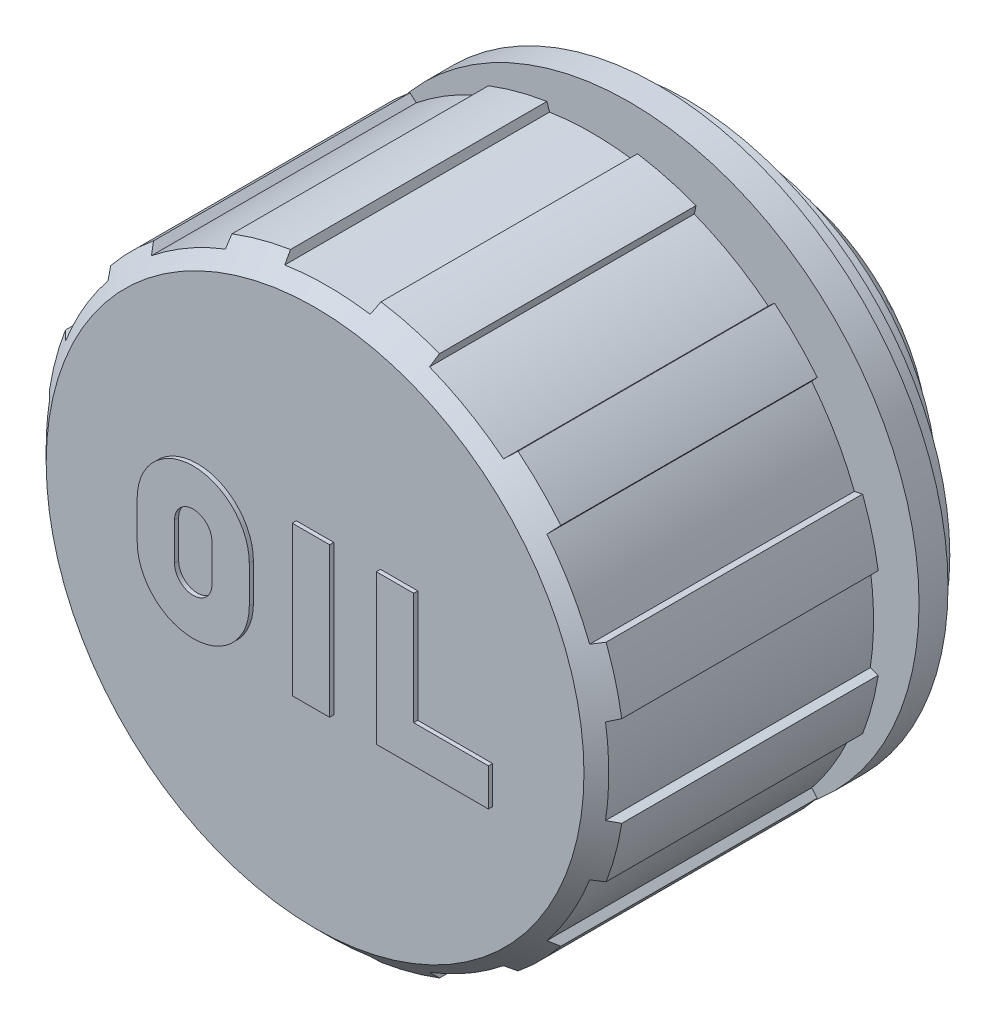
ISO-10303-21;
HEADER;
FILE_DESCRIPTION(('STEP AP214'),'2;1');
FILE_NAME('part.step','',(''),(''),'','','');
FILE_SCHEMA(('AUTOMOTIVE_DESIGN { 1 0 10303 214 1 1 1 1 }'));
ENDSEC;
DATA;
#1=APPLICATION_CONTEXT('core data for automotive mechanical design processes');
#2=APPLICATION_PROTOCOL_DEFINITION('international standard','automotive_design',2000,#1);
#3=PRODUCT_CONTEXT('',#1,'mechanical');
#4=PRODUCT('Part','Part','',(#3));
#5=PRODUCT_RELATED_PRODUCT_CATEGORY('part','',(#4));
#6=PRODUCT_DEFINITION_FORMATION('','',#4);
#7=PRODUCT_DEFINITION_CONTEXT('part definition',#1,'design');
#8=PRODUCT_DEFINITION('design','',#6,#7);
#9=PRODUCT_DEFINITION_SHAPE('','',#8);
#10=(LENGTH_UNIT() NAMED_UNIT(*) SI_UNIT(.MILLI.,.METRE.));
#11=(NAMED_UNIT(*) PLANE_ANGLE_UNIT() SI_UNIT($,.RADIAN.));
#12=(NAMED_UNIT(*) SI_UNIT($,.STERADIAN.) SOLID_ANGLE_UNIT());
#13=UNCERTAINTY_MEASURE_WITH_UNIT(LENGTH_MEASURE(1.E-05),#10,'distance_accuracy_value','');
#14=(GEOMETRIC_REPRESENTATION_CONTEXT(3) GLOBAL_UNCERTAINTY_ASSIGNED_CONTEXT((#13)) GLOBAL_UNIT_ASSIGNED_CONTEXT((#10,
#11,#12)) REPRESENTATION_CONTEXT('',''));
#15=CARTESIAN_POINT('',(0.,0.,0.));
#16=DIRECTION('',(0.,0.,1.));
#17=DIRECTION('',(1.,0.,0.));
#18=AXIS2_PLACEMENT_3D('',#15,#16,#17);
#19=CARTESIAN_POINT('',(0.,0.,9.15));
#20=DIRECTION('',(0.,0.,1.));
#21=DIRECTION('',(1.,0.,0.));
#22=AXIS2_PLACEMENT_3D('',#19,#20,#21);
#23=CYLINDRICAL_SURFACE('',#22,23.3333333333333);
#24=CARTESIAN_POINT('',(0.,0.,6.9));
#25=DIRECTION('',(0.,0.,1.));
#26=DIRECTION('',(1.,0.,0.));
#27=AXIS2_PLACEMENT_3D('',#24,#25,#26);
#28=CIRCLE('',#27,23.3333333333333);
#29=CARTESIAN_POINT('',(23.3333333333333,0.,6.9));
#30=VERTEX_POINT('',#29);
#31=EDGE_CURVE('E2198',#30,#30,#28,.T.);
#32=ORIENTED_EDGE('',*,*,#31,.T.);
#33=EDGE_LOOP('',(#32));
#34=FACE_BOUND('',#33,.T.);
#35=CARTESIAN_POINT('',(0.,0.,11.4));
#36=DIRECTION('',(0.,0.,1.));
#37=DIRECTION('',(1.,0.,0.));
#38=AXIS2_PLACEMENT_3D('',#35,#36,#37);
#39=CIRCLE('',#38,23.3333333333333);
#40=CARTESIAN_POINT('',(23.3333333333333,0.,11.4));
#41=VERTEX_POINT('',#40);
#42=EDGE_CURVE('E445',#41,#41,#39,.T.);
#43=ORIENTED_EDGE('',*,*,#42,.F.);
#44=EDGE_LOOP('',(#43));
#45=FACE_BOUND('',#44,.T.);
#46=ADVANCED_FACE('F14',(#34,#45),#23,.T.);
#47=CARTESIAN_POINT('',(0.,29.1666666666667,6.9));
#48=DIRECTION('',(0.,0.,1.));
#49=DIRECTION('',(1.,0.,0.));
#50=AXIS2_PLACEMENT_3D('',#47,#48,#49);
#51=PLANE('',#50);
#52=ORIENTED_EDGE('',*,*,#31,.F.);
#53=EDGE_LOOP('',(#52));
#54=FACE_BOUND('',#53,.T.);
#55=CARTESIAN_POINT('',(0.,0.,6.9));
#56=DIRECTION('',(0.,0.,1.));
#57=DIRECTION('',(1.,0.,0.));
#58=AXIS2_PLACEMENT_3D('',#55,#56,#57);
#59=CIRCLE('',#58,35.);
#60=CARTESIAN_POINT('',(35.,0.,6.9));
#61=VERTEX_POINT('',#60);
#62=EDGE_CURVE('E2201',#61,#61,#59,.T.);
#63=ORIENTED_EDGE('',*,*,#62,.T.);
#64=EDGE_LOOP('',(#63));
#65=FACE_BOUND('',#64,.T.);
#66=ADVANCED_FACE('F1171',(#54,#65),#51,.T.);
#67=CARTESIAN_POINT('',(0.,0.,5.15));
#68=DIRECTION('',(0.,0.,1.));
#69=DIRECTION('',(1.,0.,0.));
#70=AXIS2_PLACEMENT_3D('',#67,#68,#69);
#71=CYLINDRICAL_SURFACE('',#70,35.);
#72=CARTESIAN_POINT('',(0.,0.,3.4));
#73=DIRECTION('',(0.,0.,1.));
#74=DIRECTION('',(1.,0.,0.));
#75=AXIS2_PLACEMENT_3D('',#72,#73,#74);
#76=CIRCLE('',#75,35.);
#77=CARTESIAN_POINT('',(35.,0.,3.4));
#78=VERTEX_POINT('',#77);
#79=EDGE_CURVE('E2208',#78,#78,#76,.T.);
#80=ORIENTED_EDGE('',*,*,#79,.T.);
#81=EDGE_LOOP('',(#80));
#82=FACE_BOUND('',#81,.T.);
#83=ORIENTED_EDGE('',*,*,#62,.F.);
#84=EDGE_LOOP('',(#83));
#85=FACE_BOUND('',#84,.T.);
#86=ADVANCED_FACE('F1175',(#82,#85),#71,.T.);
#87=CARTESIAN_POINT('',(0.,33.4090909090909,3.4));
#88=DIRECTION('',(0.,0.,-1.));
#89=DIRECTION('',(-1.,0.,0.));
#90=AXIS2_PLACEMENT_3D('',#87,#88,#89);
#91=PLANE('',#90);
#92=ORIENTED_EDGE('',*,*,#79,.F.);
#93=EDGE_LOOP('',(#92));
#94=FACE_BOUND('',#93,.T.);
#95=CARTESIAN_POINT('',(0.,0.,3.4));
#96=DIRECTION('',(0.,0.,1.));
#97=DIRECTION('',(1.,0.,0.));
#98=AXIS2_PLACEMENT_3D('',#95,#96,#97);
#99=CIRCLE('',#98,31.8181818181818);
#100=CARTESIAN_POINT('',(31.8181818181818,0.,3.4));
#101=VERTEX_POINT('',#100);
#102=EDGE_CURVE('E2211',#101,#101,#99,.T.);
#103=ORIENTED_EDGE('',*,*,#102,.T.);
#104=EDGE_LOOP('',(#103));
#105=FACE_BOUND('',#104,.T.);
#106=ADVANCED_FACE('F1179',(#94,#105),#91,.T.);
#107=CARTESIAN_POINT('',(0.,0.,1.7));
#108=DIRECTION('',(0.,0.,1.));
#109=DIRECTION('',(1.,0.,0.));
#110=AXIS2_PLACEMENT_3D('',#107,#108,#109);
#111=CYLINDRICAL_SURFACE('',#110,31.8181818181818);
#112=CARTESIAN_POINT('',(0.,0.,0.));
#113=DIRECTION('',(0.,0.,1.));
#114=DIRECTION('',(1.,0.,0.));
#115=AXIS2_PLACEMENT_3D('',#112,#113,#114);
#116=CIRCLE('',#115,31.8181818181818);
#117=CARTESIAN_POINT('',(31.8181818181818,0.,0.));
#118=VERTEX_POINT('',#117);
#119=EDGE_CURVE('E2214',#118,#118,#116,.T.);
#120=ORIENTED_EDGE('',*,*,#119,.T.);
#121=EDGE_LOOP('',(#120));
#122=FACE_BOUND('',#121,.T.);
#123=ORIENTED_EDGE('',*,*,#102,.F.);
#124=EDGE_LOOP('',(#123));
#125=FACE_BOUND('',#124,.T.);
#126=ADVANCED_FACE('F1183',(#122,#125),#111,.T.);
#127=CARTESIAN_POINT('',(0.,25.6590909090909,0.));
#128=DIRECTION('',(0.,0.,-1.));
#129=DIRECTION('',(-1.,0.,0.));
#130=AXIS2_PLACEMENT_3D('',#127,#128,#129);
#131=PLANE('',#130);
#132=ORIENTED_EDGE('',*,*,#119,.F.);
#133=EDGE_LOOP('',(#132));
#134=FACE_BOUND('',#133,.T.);
#135=CARTESIAN_POINT('',(0.,0.,0.));
#136=DIRECTION('',(0.,0.,1.));
#137=DIRECTION('',(1.,0.,0.));
#138=AXIS2_PLACEMENT_3D('',#135,#136,#137);
#139=CIRCLE('',#138,19.5);
#140=CARTESIAN_POINT('',(19.5,0.,0.));
#141=VERTEX_POINT('',#140);
#142=EDGE_CURVE('E2217',#141,#141,#139,.T.);
#143=ORIENTED_EDGE('',*,*,#142,.T.);
#144=EDGE_LOOP('',(#143));
#145=FACE_BOUND('',#144,.T.);
#146=ADVANCED_FACE('F1187',(#134,#145),#131,.T.);
#147=CARTESIAN_POINT('',(0.,0.,-2.75));
#148=DIRECTION('',(0.,0.,1.));
#149=DIRECTION('',(1.,0.,0.));
#150=AXIS2_PLACEMENT_3D('',#147,#148,#149);
#151=CYLINDRICAL_SURFACE('',#150,19.5);
#152=CARTESIAN_POINT('',(0.,0.,-5.5));
#153=DIRECTION('',(0.,0.,1.));
#154=DIRECTION('',(1.,0.,0.));
#155=AXIS2_PLACEMENT_3D('',#152,#153,#154);
#156=CIRCLE('',#155,19.5);
#157=CARTESIAN_POINT('',(19.5,0.,-5.5));
#158=VERTEX_POINT('',#157);
#159=EDGE_CURVE('E2220',#158,#158,#156,.T.);
#160=ORIENTED_EDGE('',*,*,#159,.T.);
#161=EDGE_LOOP('',(#160));
#162=FACE_BOUND('',#161,.T.);
#163=ORIENTED_EDGE('',*,*,#142,.F.);
#164=EDGE_LOOP('',(#163));
#165=FACE_BOUND('',#164,.T.);
#166=ADVANCED_FACE('F1191',(#162,#165),#151,.T.);
#167=CARTESIAN_POINT('',(0.,21.75,-5.5));
#168=DIRECTION('',(0.,0.,1.));
#169=DIRECTION('',(1.,0.,0.));
#170=AXIS2_PLACEMENT_3D('',#167,#168,#169);
#171=PLANE('',#170);
#172=ORIENTED_EDGE('',*,*,#159,.F.);
#173=EDGE_LOOP('',(#172));
#174=FACE_BOUND('',#173,.T.);
#175=CARTESIAN_POINT('',(0.,0.,-5.5));
#176=DIRECTION('',(0.,0.,1.));
#177=DIRECTION('',(1.,0.,0.));
#178=AXIS2_PLACEMENT_3D('',#175,#176,#177);
#179=CIRCLE('',#178,24.);
#180=CARTESIAN_POINT('',(24.,0.,-5.5));
#181=VERTEX_POINT('',#180);
#182=EDGE_CURVE('E1218',#181,#181,#179,.T.);
#183=ORIENTED_EDGE('',*,*,#182,.T.);
#184=EDGE_LOOP('',(#183));
#185=FACE_BOUND('',#184,.T.);
#186=ADVANCED_FACE('F1195',(#174,#185),#171,.T.);
#187=CARTESIAN_POINT('',(0.,0.,-5.9));
#188=DIRECTION('',(0.,0.,1.));
#189=DIRECTION('',(1.,0.,0.));
#190=AXIS2_PLACEMENT_3D('',#187,#188,#189);
#191=CYLINDRICAL_SURFACE('',#190,24.);
#192=CARTESIAN_POINT('',(0.,0.,-6.3));
#193=DIRECTION('',(0.,0.,1.));
#194=DIRECTION('',(1.,0.,0.));
#195=AXIS2_PLACEMENT_3D('',#192,#193,#194);
#196=CIRCLE('',#195,24.);
#197=CARTESIAN_POINT('',(24.,0.,-6.3));
#198=VERTEX_POINT('',#197);
#199=EDGE_CURVE('E1213',#198,#198,#196,.T.);
#200=ORIENTED_EDGE('',*,*,#199,.T.);
#201=EDGE_LOOP('',(#200));
#202=FACE_BOUND('',#201,.T.);
#203=ORIENTED_EDGE('',*,*,#182,.F.);
#204=EDGE_LOOP('',(#203));
#205=FACE_BOUND('',#204,.T.);
#206=ADVANCED_FACE('F1199',(#202,#205),#191,.T.);
#207=CARTESIAN_POINT('',(0.,21.75,-6.3));
#208=DIRECTION('',(0.,0.,-1.));
#209=DIRECTION('',(0.,-1.,0.));
#210=AXIS2_PLACEMENT_3D('',#207,#208,#209);
#211=PLANE('',#210);
#212=ORIENTED_EDGE('',*,*,#199,.F.);
#213=EDGE_LOOP('',(#212));
#214=FACE_BOUND('',#213,.T.);
#215=CARTESIAN_POINT('',(0.,0.,-6.3));
#216=DIRECTION('',(0.,0.,1.));
#217=DIRECTION('',(1.,0.,0.));
#218=AXIS2_PLACEMENT_3D('',#215,#216,#217);
#219=CIRCLE('',#218,19.5);
#220=CARTESIAN_POINT('',(19.5,0.,-6.3));
#221=VERTEX_POINT('',#220);
#222=EDGE_CURVE('E441',#221,#221,#219,.T.);
#223=ORIENTED_EDGE('',*,*,#222,.T.);
#224=EDGE_LOOP('',(#223));
#225=FACE_BOUND('',#224,.T.);
#226=ADVANCED_FACE('F1202',(#214,#225),#211,.T.);
#227=CARTESIAN_POINT('',(0.,0.,-7.7));
#228=DIRECTION('',(0.,0.,1.));
#229=DIRECTION('',(1.,0.,0.));
#230=AXIS2_PLACEMENT_3D('',#227,#228,#229);
#231=CYLINDRICAL_SURFACE('',#230,19.5);
#232=CARTESIAN_POINT('',(0.,0.,-9.1));
#233=DIRECTION('',(0.,0.,1.));
#234=DIRECTION('',(1.,0.,0.));
#235=AXIS2_PLACEMENT_3D('',#232,#233,#234);
#236=CIRCLE('',#235,19.5);
#237=CARTESIAN_POINT('',(19.5,0.,-9.1));
#238=VERTEX_POINT('',#237);
#239=EDGE_CURVE('E423',#238,#238,#236,.T.);
#240=ORIENTED_EDGE('',*,*,#239,.T.);
#241=EDGE_LOOP('',(#240));
#242=FACE_BOUND('',#241,.T.);
#243=ORIENTED_EDGE('',*,*,#222,.F.);
#244=EDGE_LOOP('',(#243));
#245=FACE_BOUND('',#244,.T.);
#246=ADVANCED_FACE('F415',(#242,#245),#231,.T.);
#247=CARTESIAN_POINT('',(0.,0.,-9.1));
#248=DIRECTION('',(0.,0.,-1.));
#249=DIRECTION('',(-1.,0.,0.));
#250=AXIS2_PLACEMENT_3D('',#247,#248,#249);
#251=TOROIDAL_SURFACE('',#250,18.,1.5);
#252=CARTESIAN_POINT('',(0.,0.,-10.6));
#253=DIRECTION('',(0.,0.,1.));
#254=DIRECTION('',(0.,1.,0.));
#255=AXIS2_PLACEMENT_3D('',#252,#253,#254);
#256=CIRCLE('',#255,18.);
#257=CARTESIAN_POINT('',(0.,18.,-10.6));
#258=VERTEX_POINT('',#257);
#259=CARTESIAN_POINT('',(-18.,0.,-10.6));
#260=VERTEX_POINT('',#259);
#261=EDGE_CURVE('E381',#258,#260,#256,.T.);
#262=ORIENTED_EDGE('',*,*,#261,.T.);
#263=CARTESIAN_POINT('',(0.,0.,-10.6));
#264=DIRECTION('',(0.,0.,1.));
#265=DIRECTION('',(-1.,0.,0.));
#266=AXIS2_PLACEMENT_3D('',#263,#264,#265);
#267=CIRCLE('',#266,18.);
#268=CARTESIAN_POINT('',(18.,0.,-10.6));
#269=VERTEX_POINT('',#268);
#270=EDGE_CURVE('E389',#260,#269,#267,.T.);
#271=ORIENTED_EDGE('',*,*,#270,.T.);
#272=CARTESIAN_POINT('',(0.,0.,-10.6));
#273=DIRECTION('',(0.,0.,1.));
#274=DIRECTION('',(1.,0.,0.));
#275=AXIS2_PLACEMENT_3D('',#272,#273,#274);
#276=CIRCLE('',#275,18.);
#277=EDGE_CURVE('E386',#269,#258,#276,.T.);
#278=ORIENTED_EDGE('',*,*,#277,.T.);
#279=EDGE_LOOP('',(#262,#271,#278));
#280=FACE_BOUND('',#279,.T.);
#281=ORIENTED_EDGE('',*,*,#239,.F.);
#282=EDGE_LOOP('',(#281));
#283=FACE_BOUND('',#282,.T.);
#284=ADVANCED_FACE('F395',(#280,#283),#251,.T.);
#285=CARTESIAN_POINT('',(0.,14.75,-10.6));
#286=DIRECTION('',(0.,0.,-1.));
#287=DIRECTION('',(-1.,0.,0.));
#288=AXIS2_PLACEMENT_3D('',#285,#286,#287);
#289=PLANE('',#288);
#290=ORIENTED_EDGE('',*,*,#270,.F.);
#291=ORIENTED_EDGE('',*,*,#261,.F.);
#292=ORIENTED_EDGE('',*,*,#277,.F.);
#293=EDGE_LOOP('',(#290,#291,#292));
#294=FACE_BOUND('',#293,.T.);
#295=CARTESIAN_POINT('',(0.,0.,-10.6));
#296=DIRECTION('',(0.,0.,1.));
#297=DIRECTION('',(1.,0.,0.));
#298=AXIS2_PLACEMENT_3D('',#295,#296,#297);
#299=CIRCLE('',#298,11.5);
#300=CARTESIAN_POINT('',(11.5,0.,-10.6));
#301=VERTEX_POINT('',#300);
#302=EDGE_CURVE('E398',#301,#301,#299,.T.);
#303=ORIENTED_EDGE('',*,*,#302,.T.);
#304=EDGE_LOOP('',(#303));
#305=FACE_BOUND('',#304,.T.);
#306=ADVANCED_FACE('F384',(#294,#305),#289,.T.);
#307=CARTESIAN_POINT('',(0.,0.,-1.85));
#308=DIRECTION('',(0.,0.,1.));
#309=DIRECTION('',(1.,0.,0.));
#310=AXIS2_PLACEMENT_3D('',#307,#308,#309);
#311=CYLINDRICAL_SURFACE('',#310,11.5);
#312=CARTESIAN_POINT('',(0.,0.,6.9));
#313=DIRECTION('',(0.,0.,1.));
#314=DIRECTION('',(1.,0.,0.));
#315=AXIS2_PLACEMENT_3D('',#312,#313,#314);
#316=CIRCLE('',#315,11.5);
#317=CARTESIAN_POINT('',(11.5,0.,6.9));
#318=VERTEX_POINT('',#317);
#319=EDGE_CURVE('E401',#318,#318,#316,.F.);
#320=ORIENTED_EDGE('',*,*,#319,.F.);
#321=EDGE_LOOP('',(#320));
#322=FACE_BOUND('',#321,.T.);
#323=ORIENTED_EDGE('',*,*,#302,.F.);
#324=EDGE_LOOP('',(#323));
#325=FACE_BOUND('',#324,.T.);
#326=ADVANCED_FACE('F1227',(#322,#325),#311,.F.);
#327=CARTESIAN_POINT('',(0.,5.75,6.9));
#328=DIRECTION('',(0.,0.,-1.));
#329=DIRECTION('',(-1.,0.,0.));
#330=AXIS2_PLACEMENT_3D('',#327,#328,#329);
#331=PLANE('',#330);
#332=ORIENTED_EDGE('',*,*,#319,.T.);
#333=EDGE_LOOP('',(#332));
#334=FACE_BOUND('',#333,.T.);
#335=ADVANCED_FACE('F16',(#334),#331,.T.);
#336=CARTESIAN_POINT('',(0.,32.5,11.4));
#337=DIRECTION('',(0.,0.,-1.));
#338=DIRECTION('',(-1.,0.,0.));
#339=AXIS2_PLACEMENT_3D('',#336,#337,#338);
#340=PLANE('',#339);
#341=DIRECTION('',(-0.951056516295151,0.309016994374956,0.));
#342=VECTOR('',#341,1.);
#343=CARTESIAN_POINT('',(-33.6058248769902,5.16222184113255,11.4));
#344=LINE('',#343,#342);
#345=CARTESIAN_POINT('',(-33.6058248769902,5.16222184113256,11.4));
#346=VERTEX_POINT('',#345);
#347=CARTESIAN_POINT('',(-34.5690919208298,5.47520627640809,11.4));
#348=VERTEX_POINT('',#347);
#349=EDGE_CURVE('E895',#346,#348,#344,.T.);
#350=ORIENTED_EDGE('',*,*,#349,.T.);
#351=CARTESIAN_POINT('',(6.11066752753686E-13,-1.04805053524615E-13,11.4));
#352=DIRECTION('',(0.,0.,1.));
#353=DIRECTION('',(1.,0.,0.));
#354=AXIS2_PLACEMENT_3D('',#351,#352,#353);
#355=CIRCLE('',#354,35.0000000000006);
#356=CARTESIAN_POINT('',(-32.6753149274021,12.5428782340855,11.4));
#357=VERTEX_POINT('',#356);
#358=EDGE_CURVE('E808',#357,#348,#355,.T.);
#359=ORIENTED_EDGE('',*,*,#358,.F.);
#360=DIRECTION('',(0.978147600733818,-0.207911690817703,0.));
#361=VECTOR('',#360,1.);
#362=CARTESIAN_POINT('',(-32.6753149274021,12.5428782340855,11.4));
#363=LINE('',#362,#361);
#364=CARTESIAN_POINT('',(-31.6846089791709,12.3322971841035,11.4));
#365=VERTEX_POINT('',#364);
#366=EDGE_CURVE('E946',#357,#365,#363,.T.);
#367=ORIENTED_EDGE('',*,*,#366,.T.);
#368=CARTESIAN_POINT('',(2.1316282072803E-13,-1.91846538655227E-13,11.4));
#369=DIRECTION('',(0.,0.,1.));
#370=DIRECTION('',(1.,0.,0.));
#371=AXIS2_PLACEMENT_3D('',#368,#369,#370);
#372=CIRCLE('',#371,34.);
#373=CARTESIAN_POINT('',(-26.5223871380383,21.2735276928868,11.4));
#374=VERTEX_POINT('',#373);
#375=EDGE_CURVE('E813',#374,#365,#372,.T.);
#376=ORIENTED_EDGE('',*,*,#375,.F.);
#377=DIRECTION('',(-0.669130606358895,0.743144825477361,0.));
#378=VECTOR('',#377,1.);
#379=CARTESIAN_POINT('',(-26.5223871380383,21.2735276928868,11.4));
#380=LINE('',#379,#378);
#381=CARTESIAN_POINT('',(-27.200108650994,22.0262136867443,11.4));
#382=VERTEX_POINT('',#381);
#383=EDGE_CURVE('E944',#374,#382,#380,.T.);
#384=ORIENTED_EDGE('',*,*,#383,.T.);
#385=CARTESIAN_POINT('',(1.52766688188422E-13,-3.12638803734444E-13,11.4));
#386=DIRECTION('',(0.,0.,1.));
#387=DIRECTION('',(1.,0.,0.));
#388=AXIS2_PLACEMENT_3D('',#385,#386,#387);
#389=CIRCLE('',#388,35.);
#390=CARTESIAN_POINT('',(-22.0262136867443,27.200108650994,11.4));
#391=VERTEX_POINT('',#390);
#392=EDGE_CURVE('E818',#391,#382,#389,.T.);
#393=ORIENTED_EDGE('',*,*,#392,.F.);
#394=DIRECTION('',(0.743144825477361,-0.669130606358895,0.));
#395=VECTOR('',#394,1.);
#396=CARTESIAN_POINT('',(-22.0262136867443,27.200108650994,11.4));
#397=LINE('',#396,#395);
#398=CARTESIAN_POINT('',(-21.2735276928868,26.5223871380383,11.4));
#399=VERTEX_POINT('',#398);
#400=EDGE_CURVE('E942',#391,#399,#397,.T.);
#401=ORIENTED_EDGE('',*,*,#400,.T.);
#402=CARTESIAN_POINT('',(0.,-1.4210854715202E-13,11.4));
#403=DIRECTION('',(0.,0.,1.));
#404=DIRECTION('',(1.,0.,0.));
#405=AXIS2_PLACEMENT_3D('',#402,#403,#404);
#406=CIRCLE('',#405,34.);
#407=CARTESIAN_POINT('',(-12.3322971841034,31.6846089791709,11.4));
#408=VERTEX_POINT('',#407);
#409=EDGE_CURVE('E823',#408,#399,#406,.T.);
#410=ORIENTED_EDGE('',*,*,#409,.F.);
#411=DIRECTION('',(-0.207911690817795,0.978147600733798,0.));
#412=VECTOR('',#411,1.);
#413=CARTESIAN_POINT('',(-12.3322971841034,31.6846089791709,11.4));
#414=LINE('',#413,#412);
#415=CARTESIAN_POINT('',(-12.5428782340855,32.6753149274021,11.4));
#416=VERTEX_POINT('',#415);
#417=EDGE_CURVE('E940',#408,#416,#414,.T.);
#418=ORIENTED_EDGE('',*,*,#417,.T.);
#419=CARTESIAN_POINT('',(1.58095758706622E-13,-1.62003743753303E-12,11.4));
#420=DIRECTION('',(0.,0.,1.));
#421=DIRECTION('',(1.,0.,0.));
#422=AXIS2_PLACEMENT_3D('',#419,#420,#421);
#423=CIRCLE('',#422,35.0000000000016);
#424=CARTESIAN_POINT('',(-5.47520627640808,34.5690919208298,11.4));
#425=VERTEX_POINT('',#424);
#426=EDGE_CURVE('E828',#425,#416,#423,.T.);
#427=ORIENTED_EDGE('',*,*,#426,.F.);
#428=DIRECTION('',(0.309016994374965,-0.951056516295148,0.));
#429=VECTOR('',#428,1.);
#430=CARTESIAN_POINT('',(-5.47520627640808,34.5690919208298,11.4));
#431=LINE('',#430,#429);
#432=CARTESIAN_POINT('',(-5.16222184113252,33.6058248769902,11.4));
#433=VERTEX_POINT('',#432);
#434=EDGE_CURVE('E938',#425,#433,#431,.T.);
#435=ORIENTED_EDGE('',*,*,#434,.T.);
#436=CARTESIAN_POINT('',(1.54543045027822E-13,2.34479102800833E-13,11.4));
#437=DIRECTION('',(0.,0.,1.));
#438=DIRECTION('',(1.,0.,0.));
#439=AXIS2_PLACEMENT_3D('',#436,#437,#438);
#440=CIRCLE('',#439,34.);
#441=CARTESIAN_POINT('',(5.16222184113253,33.6058248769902,11.4));
#442=VERTEX_POINT('',#441);
#443=EDGE_CURVE('E833',#442,#433,#440,.T.);
#444=ORIENTED_EDGE('',*,*,#443,.F.);
#445=DIRECTION('',(0.309016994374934,0.951056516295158,0.));
#446=VECTOR('',#445,1.);
#447=CARTESIAN_POINT('',(5.16222184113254,33.6058248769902,11.4));
#448=LINE('',#447,#446);
#449=CARTESIAN_POINT('',(5.47520627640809,34.5690919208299,11.4));
#450=VERTEX_POINT('',#449);
#451=EDGE_CURVE('E936',#442,#450,#448,.T.);
#452=ORIENTED_EDGE('',*,*,#451,.T.);
#453=CARTESIAN_POINT('',(-5.04485342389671E-13,-1.04449782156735E-12,11.4));
#454=DIRECTION('',(0.,0.,1.));
#455=DIRECTION('',(1.,0.,0.));
#456=AXIS2_PLACEMENT_3D('',#453,#454,#455);
#457=CIRCLE('',#456,35.0000000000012);
#458=CARTESIAN_POINT('',(12.5428782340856,32.6753149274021,11.4));
#459=VERTEX_POINT('',#458);
#460=EDGE_CURVE('E838',#459,#450,#457,.T.);
#461=ORIENTED_EDGE('',*,*,#460,.F.);
#462=DIRECTION('',(-0.207911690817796,-0.978147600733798,0.));
#463=VECTOR('',#462,1.);
#464=CARTESIAN_POINT('',(12.5428782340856,32.675314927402,11.4));
#465=LINE('',#464,#463);
#466=CARTESIAN_POINT('',(12.3322971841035,31.6846089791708,11.4));
#467=VERTEX_POINT('',#466);
#468=EDGE_CURVE('E934',#459,#467,#465,.T.);
#469=ORIENTED_EDGE('',*,*,#468,.T.);
#470=CARTESIAN_POINT('',(4.72510919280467E-13,4.72510919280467E-13,11.4));
#471=DIRECTION('',(0.,0.,1.));
#472=DIRECTION('',(1.,0.,0.));
#473=AXIS2_PLACEMENT_3D('',#470,#471,#472);
#474=CIRCLE('',#473,33.9999999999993);
#475=CARTESIAN_POINT('',(21.2735276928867,26.5223871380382,11.4));
#476=VERTEX_POINT('',#475);
#477=EDGE_CURVE('E843',#476,#467,#474,.T.);
#478=ORIENTED_EDGE('',*,*,#477,.F.);
#479=DIRECTION('',(0.743144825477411,0.66913060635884,0.));
#480=VECTOR('',#479,1.);
#481=CARTESIAN_POINT('',(21.2735276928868,26.5223871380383,11.4));
#482=LINE('',#481,#480);
#483=CARTESIAN_POINT('',(22.0262136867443,27.2001086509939,11.4));
#484=VERTEX_POINT('',#483);
#485=EDGE_CURVE('E932',#476,#484,#482,.T.);
#486=ORIENTED_EDGE('',*,*,#485,.T.);
#487=CARTESIAN_POINT('',(6.60804744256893E-13,5.61328761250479E-13,11.4));
#488=DIRECTION('',(0.,0.,1.));
#489=DIRECTION('',(1.,0.,0.));
#490=AXIS2_PLACEMENT_3D('',#487,#488,#489);
#491=CIRCLE('',#490,34.9999999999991);
#492=CARTESIAN_POINT('',(27.200108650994,22.0262136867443,11.4));
#493=VERTEX_POINT('',#492);
#494=EDGE_CURVE('E848',#493,#484,#491,.T.);
#495=ORIENTED_EDGE('',*,*,#494,.F.);
#496=DIRECTION('',(-0.669130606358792,-0.743144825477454,0.));
#497=VECTOR('',#496,1.);
#498=CARTESIAN_POINT('',(27.200108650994,22.0262136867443,11.4));
#499=LINE('',#498,#497);
#500=CARTESIAN_POINT('',(26.5223871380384,21.2735276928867,11.4));
#501=VERTEX_POINT('',#500);
#502=EDGE_CURVE('E930',#493,#501,#499,.T.);
#503=ORIENTED_EDGE('',*,*,#502,.T.);
#504=CARTESIAN_POINT('',(0.,0.,11.4));
#505=DIRECTION('',(0.,0.,1.));
#506=DIRECTION('',(1.,0.,0.));
#507=AXIS2_PLACEMENT_3D('',#504,#505,#506);
#508=CIRCLE('',#507,34.);
#509=CARTESIAN_POINT('',(31.6846089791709,12.3322971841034,11.4));
#510=VERTEX_POINT('',#509);
#511=EDGE_CURVE('E853',#510,#501,#508,.T.);
#512=ORIENTED_EDGE('',*,*,#511,.F.);
#513=DIRECTION('',(0.978147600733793,0.207911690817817,0.));
#514=VECTOR('',#513,1.);
#515=CARTESIAN_POINT('',(31.6846089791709,12.3322971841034,11.4));
#516=LINE('',#515,#514);
#517=CARTESIAN_POINT('',(32.675314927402,12.5428782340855,11.4));
#518=VERTEX_POINT('',#517);
#519=EDGE_CURVE('E928',#510,#518,#516,.T.);
#520=ORIENTED_EDGE('',*,*,#519,.T.);
#521=CARTESIAN_POINT('',(1.442401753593E-12,2.17603712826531E-13,11.4));
#522=DIRECTION('',(0.,0.,1.));
#523=DIRECTION('',(1.,0.,0.));
#524=AXIS2_PLACEMENT_3D('',#521,#522,#523);
#525=CIRCLE('',#524,34.9999999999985);
#526=CARTESIAN_POINT('',(34.5690919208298,5.47520627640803,11.4));
#527=VERTEX_POINT('',#526);
#528=EDGE_CURVE('E858',#527,#518,#525,.T.);
#529=ORIENTED_EDGE('',*,*,#528,.F.);
#530=DIRECTION('',(-0.951056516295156,-0.30901699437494,0.));
#531=VECTOR('',#530,1.);
#532=CARTESIAN_POINT('',(34.5690919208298,5.47520627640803,11.4));
#533=LINE('',#532,#531);
#534=CARTESIAN_POINT('',(33.6058248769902,5.16222184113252,11.4));
#535=VERTEX_POINT('',#534);
#536=EDGE_CURVE('E926',#527,#535,#533,.T.);
#537=ORIENTED_EDGE('',*,*,#536,.T.);
#538=CARTESIAN_POINT('',(2.41584530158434E-13,0.,11.4));
#539=DIRECTION('',(0.,0.,1.));
#540=DIRECTION('',(1.,0.,0.));
#541=AXIS2_PLACEMENT_3D('',#538,#539,#540);
#542=CIRCLE('',#541,34.);
#543=CARTESIAN_POINT('',(33.6058248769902,-5.16222184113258,11.4));
#544=VERTEX_POINT('',#543);
#545=EDGE_CURVE('E863',#544,#535,#542,.T.);
#546=ORIENTED_EDGE('',*,*,#545,.F.);
#547=DIRECTION('',(0.951056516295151,-0.309016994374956,0.));
#548=VECTOR('',#547,1.);
#549=CARTESIAN_POINT('',(33.6058248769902,-5.16222184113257,11.4));
#550=LINE('',#549,#548);
#551=CARTESIAN_POINT('',(34.5690919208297,-5.47520627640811,11.4));
#552=VERTEX_POINT('',#551);
#553=EDGE_CURVE('E924',#544,#552,#550,.T.);
#554=ORIENTED_EDGE('',*,*,#553,.T.);
#555=CARTESIAN_POINT('',(-3.69482222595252E-13,0.,11.4));
#556=DIRECTION('',(0.,0.,1.));
#557=DIRECTION('',(1.,0.,0.));
#558=AXIS2_PLACEMENT_3D('',#555,#556,#557);
#559=CIRCLE('',#558,35.);
#560=CARTESIAN_POINT('',(32.675314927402,-12.5428782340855,11.4));
#561=VERTEX_POINT('',#560);
#562=EDGE_CURVE('E868',#561,#552,#559,.T.);
#563=ORIENTED_EDGE('',*,*,#562,.F.);
#564=DIRECTION('',(-0.978147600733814,0.207911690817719,0.));
#565=VECTOR('',#564,1.);
#566=CARTESIAN_POINT('',(32.675314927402,-12.5428782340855,11.4));
#567=LINE('',#566,#565);
#568=CARTESIAN_POINT('',(31.6846089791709,-12.3322971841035,11.4));
#569=VERTEX_POINT('',#568);
#570=EDGE_CURVE('E922',#561,#569,#567,.T.);
#571=ORIENTED_EDGE('',*,*,#570,.T.);
#572=CARTESIAN_POINT('',(-3.23296944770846E-13,3.01980662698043E-13,11.4));
#573=DIRECTION('',(0.,0.,1.));
#574=DIRECTION('',(1.,0.,0.));
#575=AXIS2_PLACEMENT_3D('',#572,#573,#574);
#576=CIRCLE('',#575,34.0000000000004);
#577=CARTESIAN_POINT('',(26.5223871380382,-21.2735276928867,11.4));
#578=VERTEX_POINT('',#577);
#579=EDGE_CURVE('E873',#578,#569,#576,.T.);
#580=ORIENTED_EDGE('',*,*,#579,.F.);
#581=DIRECTION('',(0.669130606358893,-0.743144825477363,0.));
#582=VECTOR('',#581,1.);
#583=CARTESIAN_POINT('',(26.5223871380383,-21.2735276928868,11.4));
#584=LINE('',#583,#582);
#585=CARTESIAN_POINT('',(27.200108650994,-22.0262136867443,11.4));
#586=VERTEX_POINT('',#585);
#587=EDGE_CURVE('E920',#578,#586,#584,.T.);
#588=ORIENTED_EDGE('',*,*,#587,.T.);
#589=CARTESIAN_POINT('',(9.02389274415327E-13,-8.10018718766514E-13,11.4));
#590=DIRECTION('',(0.,0.,1.));
#591=DIRECTION('',(1.,0.,0.));
#592=AXIS2_PLACEMENT_3D('',#589,#590,#591);
#593=CIRCLE('',#592,34.9999999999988);
#594=CARTESIAN_POINT('',(22.0262136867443,-27.200108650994,11.4));
#595=VERTEX_POINT('',#594);
#596=EDGE_CURVE('E716',#595,#586,#593,.T.);
#597=ORIENTED_EDGE('',*,*,#596,.F.);
#598=DIRECTION('',(-0.743144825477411,0.66913060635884,0.));
#599=VECTOR('',#598,1.);
#600=CARTESIAN_POINT('',(22.0262136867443,-27.200108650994,11.4));
#601=LINE('',#600,#599);
#602=CARTESIAN_POINT('',(21.2735276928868,-26.5223871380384,11.4));
#603=VERTEX_POINT('',#602);
#604=EDGE_CURVE('E712',#595,#603,#601,.T.);
#605=ORIENTED_EDGE('',*,*,#604,.T.);
#606=CARTESIAN_POINT('',(0.,2.70006239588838E-13,11.4));
#607=DIRECTION('',(0.,0.,1.));
#608=DIRECTION('',(1.,0.,0.));
#609=AXIS2_PLACEMENT_3D('',#606,#607,#608);
#610=CIRCLE('',#609,34.);
#611=CARTESIAN_POINT('',(12.3322971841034,-31.6846089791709,11.4));
#612=VERTEX_POINT('',#611);
#613=EDGE_CURVE('E734',#612,#603,#610,.T.);
#614=ORIENTED_EDGE('',*,*,#613,.F.);
#615=DIRECTION('',(0.207911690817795,-0.978147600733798,0.));
#616=VECTOR('',#615,1.);
#617=CARTESIAN_POINT('',(12.3322971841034,-31.6846089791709,11.4));
#618=LINE('',#617,#616);
#619=CARTESIAN_POINT('',(12.5428782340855,-32.6753149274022,11.4));
#620=VERTEX_POINT('',#619);
#621=EDGE_CURVE('E917',#612,#620,#618,.T.);
#622=ORIENTED_EDGE('',*,*,#621,.T.);
#623=CARTESIAN_POINT('',(0.,8.81072992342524E-13,11.4));
#624=DIRECTION('',(0.,0.,1.));
#625=DIRECTION('',(1.,0.,0.));
#626=AXIS2_PLACEMENT_3D('',#623,#624,#625);
#627=CIRCLE('',#626,35.0000000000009);
#628=CARTESIAN_POINT('',(5.47520627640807,-34.5690919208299,11.4));
#629=VERTEX_POINT('',#628);
#630=EDGE_CURVE('E740',#629,#620,#627,.T.);
#631=ORIENTED_EDGE('',*,*,#630,.F.);
#632=DIRECTION('',(-0.309016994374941,0.951056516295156,0.));
#633=VECTOR('',#632,1.);
#634=CARTESIAN_POINT('',(5.47520627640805,-34.5690919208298,11.4));
#635=LINE('',#634,#633);
#636=CARTESIAN_POINT('',(5.16222184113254,-33.6058248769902,11.4));
#637=VERTEX_POINT('',#636);
#638=EDGE_CURVE('E892',#629,#637,#635,.T.);
#639=ORIENTED_EDGE('',*,*,#638,.T.);
#640=CARTESIAN_POINT('',(0.,-2.34479102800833E-13,11.4));
#641=DIRECTION('',(0.,0.,1.));
#642=DIRECTION('',(1.,0.,0.));
#643=AXIS2_PLACEMENT_3D('',#640,#641,#642);
#644=CIRCLE('',#643,34.);
#645=CARTESIAN_POINT('',(-5.16222184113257,-33.6058248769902,11.4));
#646=VERTEX_POINT('',#645);
#647=EDGE_CURVE('E773',#646,#637,#644,.T.);
#648=ORIENTED_EDGE('',*,*,#647,.F.);
#649=DIRECTION('',(-0.309016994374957,-0.95105651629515,0.));
#650=VECTOR('',#649,1.);
#651=CARTESIAN_POINT('',(-5.16222184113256,-33.6058248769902,11.4));
#652=LINE('',#651,#650);
#653=CARTESIAN_POINT('',(-5.47520627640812,-34.5690919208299,11.4));
#654=VERTEX_POINT('',#653);
#655=EDGE_CURVE('E915',#646,#654,#652,.T.);
#656=ORIENTED_EDGE('',*,*,#655,.T.);
#657=CARTESIAN_POINT('',(2.8066438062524E-13,1.55608859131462E-12,11.4));
#658=DIRECTION('',(0.,0.,1.));
#659=DIRECTION('',(1.,0.,0.));
#660=AXIS2_PLACEMENT_3D('',#657,#658,#659);
#661=CIRCLE('',#660,35.0000000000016);
#662=CARTESIAN_POINT('',(-12.5428782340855,-32.6753149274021,11.4));
#663=VERTEX_POINT('',#662);
#664=EDGE_CURVE('E778',#663,#654,#661,.T.);
#665=ORIENTED_EDGE('',*,*,#664,.F.);
#666=DIRECTION('',(0.207911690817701,0.978147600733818,0.));
#667=VECTOR('',#666,1.);
#668=CARTESIAN_POINT('',(-12.5428782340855,-32.6753149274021,11.4));
#669=LINE('',#668,#667);
#670=CARTESIAN_POINT('',(-12.3322971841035,-31.6846089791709,11.4));
#671=VERTEX_POINT('',#670);
#672=EDGE_CURVE('E913',#663,#671,#669,.T.);
#673=ORIENTED_EDGE('',*,*,#672,.T.);
#674=CARTESIAN_POINT('',(0.,0.,11.4));
#675=DIRECTION('',(0.,0.,1.));
#676=DIRECTION('',(1.,0.,0.));
#677=AXIS2_PLACEMENT_3D('',#674,#675,#676);
#678=CIRCLE('',#677,34.);
#679=CARTESIAN_POINT('',(-21.2735276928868,-26.5223871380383,11.4));
#680=VERTEX_POINT('',#679);
#681=EDGE_CURVE('E783',#680,#671,#678,.T.);
#682=ORIENTED_EDGE('',*,*,#681,.F.);
#683=DIRECTION('',(-0.74314482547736,-0.669130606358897,0.));
#684=VECTOR('',#683,1.);
#685=CARTESIAN_POINT('',(-21.2735276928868,-26.5223871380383,11.4));
#686=LINE('',#685,#684);
#687=CARTESIAN_POINT('',(-22.0262136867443,-27.200108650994,11.4));
#688=VERTEX_POINT('',#687);
#689=EDGE_CURVE('E911',#680,#688,#686,.T.);
#690=ORIENTED_EDGE('',*,*,#689,.T.);
#691=CARTESIAN_POINT('',(0.,0.,11.4));
#692=DIRECTION('',(0.,0.,1.));
#693=DIRECTION('',(1.,0.,0.));
#694=AXIS2_PLACEMENT_3D('',#691,#692,#693);
#695=CIRCLE('',#694,35.);
#696=CARTESIAN_POINT('',(-27.200108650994,-22.0262136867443,11.4));
#697=VERTEX_POINT('',#696);
#698=EDGE_CURVE('E788',#697,#688,#695,.T.);
#699=ORIENTED_EDGE('',*,*,#698,.F.);
#700=DIRECTION('',(0.669130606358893,0.743144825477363,0.));
#701=VECTOR('',#700,1.);
#702=CARTESIAN_POINT('',(-27.200108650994,-22.0262136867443,11.4));
#703=LINE('',#702,#701);
#704=CARTESIAN_POINT('',(-26.5223871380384,-21.2735276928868,11.4));
#705=VERTEX_POINT('',#704);
#706=EDGE_CURVE('E909',#697,#705,#703,.T.);
#707=ORIENTED_EDGE('',*,*,#706,.T.);
#708=CARTESIAN_POINT('',(0.,0.,11.4));
#709=DIRECTION('',(0.,0.,1.));
#710=DIRECTION('',(1.,0.,0.));
#711=AXIS2_PLACEMENT_3D('',#708,#709,#710);
#712=CIRCLE('',#711,34.);
#713=CARTESIAN_POINT('',(-31.6846089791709,-12.3322971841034,11.4));
#714=VERTEX_POINT('',#713);
#715=EDGE_CURVE('E793',#714,#705,#712,.T.);
#716=ORIENTED_EDGE('',*,*,#715,.F.);
#717=DIRECTION('',(-0.978147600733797,-0.207911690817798,0.));
#718=VECTOR('',#717,1.);
#719=CARTESIAN_POINT('',(-31.6846089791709,-12.3322971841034,11.4));
#720=LINE('',#719,#718);
#721=CARTESIAN_POINT('',(-32.6753149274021,-12.5428782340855,11.4));
#722=VERTEX_POINT('',#721);
#723=EDGE_CURVE('E907',#714,#722,#720,.T.);
#724=ORIENTED_EDGE('',*,*,#723,.T.);
#725=CARTESIAN_POINT('',(0.,0.,11.4));
#726=DIRECTION('',(0.,0.,1.));
#727=DIRECTION('',(1.,0.,0.));
#728=AXIS2_PLACEMENT_3D('',#725,#726,#727);
#729=CIRCLE('',#728,35.);
#730=CARTESIAN_POINT('',(-34.5690919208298,-5.47520627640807,11.4));
#731=VERTEX_POINT('',#730);
#732=EDGE_CURVE('E798',#731,#722,#729,.T.);
#733=ORIENTED_EDGE('',*,*,#732,.F.);
#734=DIRECTION('',(0.951056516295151,0.309016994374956,0.));
#735=VECTOR('',#734,1.);
#736=CARTESIAN_POINT('',(-34.5690919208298,-5.47520627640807,11.4));
#737=LINE('',#736,#735);
#738=CARTESIAN_POINT('',(-33.6058248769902,-5.16222184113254,11.4));
#739=VERTEX_POINT('',#738);
#740=EDGE_CURVE('E901',#731,#739,#737,.T.);
#741=ORIENTED_EDGE('',*,*,#740,.T.);
#742=CARTESIAN_POINT('',(0.,0.,11.4));
#743=DIRECTION('',(0.,0.,1.));
#744=DIRECTION('',(1.,0.,0.));
#745=AXIS2_PLACEMENT_3D('',#742,#743,#744);
#746=CIRCLE('',#745,34.);
#747=EDGE_CURVE('E803',#346,#739,#746,.T.);
#748=ORIENTED_EDGE('',*,*,#747,.F.);
#749=EDGE_LOOP('',(#350,#359,#367,#376,#384,#393,#401,#410,#418,#427,#435,#444,#452,#461,#469,
#478,#486,#495,#503,#512,#520,#529,#537,#546,#554,#563,#571,#580,#588,#597,#605,#614,#622,#631,
#639,#648,#656,#665,#673,#682,#690,#699,#707,#716,#724,#733,#741,#748));
#750=FACE_BOUND('',#749,.T.);
#751=ORIENTED_EDGE('',*,*,#42,.T.);
#752=EDGE_LOOP('',(#751));
#753=FACE_BOUND('',#752,.T.);
#754=ADVANCED_FACE('F1234',(#750,#753),#340,.T.);
#755=CARTESIAN_POINT('',(-33.6058248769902,5.16222184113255,45.4));
#756=DIRECTION('',(0.309016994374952,0.951056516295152,0.));
#757=DIRECTION('',(-0.951056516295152,0.309016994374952,0.));
#758=AXIS2_PLACEMENT_3D('',#755,#756,#757);
#759=PLANE('',#758);
#760=DIRECTION('',(0.,0.,1.));
#761=VECTOR('',#760,1.);
#762=CARTESIAN_POINT('',(-34.5690919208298,5.47520627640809,45.4));
#763=LINE('',#762,#761);
#764=CARTESIAN_POINT('',(-34.5690919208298,5.47520627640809,42.4));
#765=VERTEX_POINT('',#764);
#766=EDGE_CURVE('E811',#348,#765,#763,.T.);
#767=ORIENTED_EDGE('',*,*,#766,.F.);
#768=ORIENTED_EDGE('',*,*,#349,.F.);
#769=DIRECTION('',(0.,0.,1.));
#770=VECTOR('',#769,1.);
#771=CARTESIAN_POINT('',(-33.6058248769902,5.16222184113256,45.4));
#772=LINE('',#771,#770);
#773=CARTESIAN_POINT('',(-33.6058248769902,5.16222184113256,43.4));
#774=VERTEX_POINT('',#773);
#775=EDGE_CURVE('E807',#774,#346,#772,.F.);
#776=ORIENTED_EDGE('',*,*,#775,.F.);
#777=CARTESIAN_POINT('',(-34.5690919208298,5.47520627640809,42.4));
#778=CARTESIAN_POINT('',(-34.4085770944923,5.42305184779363,42.5666982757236));
#779=CARTESIAN_POINT('',(-34.2480474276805,5.37089259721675,42.7333807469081));
#780=CARTESIAN_POINT('',(-33.9269584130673,5.26656445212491,43.0667140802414));
#781=CARTESIAN_POINT('',(-33.7663990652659,5.21439555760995,43.2333649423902));
#782=CARTESIAN_POINT('',(-33.6058248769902,5.16222184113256,43.4));
#783=B_SPLINE_CURVE_WITH_KNOTS('',3,(#777,#778,#779,#780,#781,#782),.UNSPECIFIED.,.F.,.F.,(4,2,
4),(0.,0.711660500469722,1.42332100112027),.UNSPECIFIED.);
#784=EDGE_CURVE('E624',#765,#774,#783,.T.);
#785=ORIENTED_EDGE('',*,*,#784,.F.);
#786=EDGE_LOOP('',(#767,#768,#776,#785));
#787=FACE_BOUND('',#786,.T.);
#788=ADVANCED_FACE('F1563',(#787),#759,.F.);
#789=CARTESIAN_POINT('',(6.11066752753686E-13,-1.04805053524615E-13,45.4));
#790=DIRECTION('',(0.,0.,1.));
#791=DIRECTION('',(1.,0.,0.));
#792=AXIS2_PLACEMENT_3D('',#789,#790,#791);
#793=CYLINDRICAL_SURFACE('',#792,35.0000000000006);
#794=ORIENTED_EDGE('',*,*,#358,.T.);
#795=ORIENTED_EDGE('',*,*,#766,.T.);
#796=CARTESIAN_POINT('',(0.,0.,42.4));
#797=DIRECTION('',(0.,0.,-1.));
#798=DIRECTION('',(0.,1.,0.));
#799=AXIS2_PLACEMENT_3D('',#796,#797,#798);
#800=CIRCLE('',#799,35.);
#801=CARTESIAN_POINT('',(-32.6753149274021,12.5428782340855,42.4));
#802=VERTEX_POINT('',#801);
#803=EDGE_CURVE('E991',#802,#765,#800,.F.);
#804=ORIENTED_EDGE('',*,*,#803,.F.);
#805=DIRECTION('',(0.,0.,1.));
#806=VECTOR('',#805,1.);
#807=CARTESIAN_POINT('',(-32.6753149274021,12.5428782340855,45.4));
#808=LINE('',#807,#806);
#809=EDGE_CURVE('E812',#802,#357,#808,.F.);
#810=ORIENTED_EDGE('',*,*,#809,.T.);
#811=EDGE_LOOP('',(#794,#795,#804,#810));
#812=FACE_BOUND('',#811,.T.);
#813=ADVANCED_FACE('F1595',(#812),#793,.T.);
#814=CARTESIAN_POINT('',(-32.6753149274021,12.5428782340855,45.4));
#815=DIRECTION('',(-0.207911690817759,-0.978147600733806,0.));
#816=DIRECTION('',(0.978147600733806,-0.207911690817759,0.));
#817=AXIS2_PLACEMENT_3D('',#814,#815,#816);
#818=PLANE('',#817);
#819=DIRECTION('',(0.,0.,1.));
#820=VECTOR('',#819,1.);
#821=CARTESIAN_POINT('',(-31.6846089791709,12.3322971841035,45.4));
#822=LINE('',#821,#820);
#823=CARTESIAN_POINT('',(-31.6846089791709,12.3322971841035,43.4));
#824=VERTEX_POINT('',#823);
#825=EDGE_CURVE('E816',#365,#824,#822,.T.);
#826=ORIENTED_EDGE('',*,*,#825,.F.);
#827=ORIENTED_EDGE('',*,*,#366,.F.);
#828=ORIENTED_EDGE('',*,*,#809,.F.);
#829=CARTESIAN_POINT('',(-31.6846089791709,12.3322971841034,43.4));
#830=CARTESIAN_POINT('',(-31.8497571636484,12.367400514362,43.2333649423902));
#831=CARTESIAN_POINT('',(-32.0148900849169,12.4025006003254,43.0667140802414));
#832=CARTESIAN_POINT('',(-32.345125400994,12.4726942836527,42.7333807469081));
#833=CARTESIAN_POINT('',(-32.5102277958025,12.5077878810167,42.5666982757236));
#834=CARTESIAN_POINT('',(-32.6753149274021,12.5428782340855,42.4));
#835=B_SPLINE_CURVE_WITH_KNOTS('',3,(#829,#830,#831,#832,#833,#834),.UNSPECIFIED.,.F.,.F.,(4,2,
4),(0.,0.711660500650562,1.42332100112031),.UNSPECIFIED.);
#836=EDGE_CURVE('E632',#824,#802,#835,.T.);
#837=ORIENTED_EDGE('',*,*,#836,.F.);
#838=EDGE_LOOP('',(#826,#827,#828,#837));
#839=FACE_BOUND('',#838,.T.);
#840=ADVANCED_FACE('F1597',(#839),#818,.F.);
#841=CARTESIAN_POINT('',(2.1316282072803E-13,-1.91846538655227E-13,45.4));
#842=DIRECTION('',(0.,0.,1.));
#843=DIRECTION('',(1.,0.,0.));
#844=AXIS2_PLACEMENT_3D('',#841,#842,#843);
#845=CYLINDRICAL_SURFACE('',#844,34.);
#846=ORIENTED_EDGE('',*,*,#375,.T.);
#847=ORIENTED_EDGE('',*,*,#825,.T.);
#848=CARTESIAN_POINT('',(0.,0.,43.4));
#849=DIRECTION('',(0.,0.,-1.));
#850=DIRECTION('',(0.,1.,0.));
#851=AXIS2_PLACEMENT_3D('',#848,#849,#850);
#852=CIRCLE('',#851,34.);
#853=CARTESIAN_POINT('',(-26.5223871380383,21.2735276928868,43.4));
#854=VERTEX_POINT('',#853);
#855=EDGE_CURVE('E998',#854,#824,#852,.F.);
#856=ORIENTED_EDGE('',*,*,#855,.F.);
#857=DIRECTION('',(0.,0.,1.));
#858=VECTOR('',#857,1.);
#859=CARTESIAN_POINT('',(-26.5223871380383,21.2735276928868,45.4));
#860=LINE('',#859,#858);
#861=EDGE_CURVE('E817',#854,#374,#860,.F.);
#862=ORIENTED_EDGE('',*,*,#861,.T.);
#863=EDGE_LOOP('',(#846,#847,#856,#862));
#864=FACE_BOUND('',#863,.T.);
#865=ADVANCED_FACE('F1600',(#864),#845,.T.);
#866=CARTESIAN_POINT('',(-26.5223871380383,21.2735276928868,45.4));
#867=DIRECTION('',(0.743144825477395,0.669130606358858,0.));
#868=DIRECTION('',(-0.669130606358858,0.743144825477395,0.));
#869=AXIS2_PLACEMENT_3D('',#866,#867,#868);
#870=PLANE('',#869);
#871=DIRECTION('',(0.,0.,1.));
#872=VECTOR('',#871,1.);
#873=CARTESIAN_POINT('',(-27.200108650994,22.0262136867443,45.4));
#874=LINE('',#873,#872);
#875=CARTESIAN_POINT('',(-27.200108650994,22.0262136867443,42.4));
#876=VERTEX_POINT('',#875);
#877=EDGE_CURVE('E821',#382,#876,#874,.T.);
#878=ORIENTED_EDGE('',*,*,#877,.F.);
#879=ORIENTED_EDGE('',*,*,#383,.F.);
#880=ORIENTED_EDGE('',*,*,#861,.F.);
#881=CARTESIAN_POINT('',(-27.200108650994,22.0262136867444,42.4));
#882=CARTESIAN_POINT('',(-27.0871759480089,21.9007892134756,42.5666982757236));
#883=CARTESIAN_POINT('',(-26.9742328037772,21.7753531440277,42.7333807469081));
#884=CARTESIAN_POINT('',(-26.748325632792,21.5244578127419,43.0667140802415));
#885=CARTESIAN_POINT('',(-26.6353616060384,21.3989985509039,43.2333649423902));
#886=CARTESIAN_POINT('',(-26.5223871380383,21.2735276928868,43.4));
#887=B_SPLINE_CURVE_WITH_KNOTS('',3,(#881,#882,#883,#884,#885,#886),.UNSPECIFIED.,.F.,.F.,(4,2,
4),(0.,0.711660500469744,1.42332100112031),.UNSPECIFIED.);
#888=EDGE_CURVE('E639',#876,#854,#887,.T.);
#889=ORIENTED_EDGE('',*,*,#888,.F.);
#890=EDGE_LOOP('',(#878,#879,#880,#889));
#891=FACE_BOUND('',#890,.T.);
#892=ADVANCED_FACE('F657',(#891),#870,.F.);
#893=CARTESIAN_POINT('',(1.52766688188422E-13,-3.12638803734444E-13,45.4));
#894=DIRECTION('',(0.,0.,1.));
#895=DIRECTION('',(1.,0.,0.));
#896=AXIS2_PLACEMENT_3D('',#893,#894,#895);
#897=CYLINDRICAL_SURFACE('',#896,35.);
#898=ORIENTED_EDGE('',*,*,#392,.T.);
#899=ORIENTED_EDGE('',*,*,#877,.T.);
#900=CARTESIAN_POINT('',(0.,0.,42.4));
#901=DIRECTION('',(0.,0.,-1.));
#902=DIRECTION('',(0.,1.,0.));
#903=AXIS2_PLACEMENT_3D('',#900,#901,#902);
#904=CIRCLE('',#903,35.);
#905=CARTESIAN_POINT('',(-22.0262136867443,27.200108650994,42.4));
#906=VERTEX_POINT('',#905);
#907=EDGE_CURVE('E1005',#906,#876,#904,.F.);
#908=ORIENTED_EDGE('',*,*,#907,.F.);
#909=DIRECTION('',(0.,0.,1.));
#910=VECTOR('',#909,1.);
#911=CARTESIAN_POINT('',(-22.0262136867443,27.200108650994,45.4));
#912=LINE('',#911,#910);
#913=EDGE_CURVE('E822',#906,#391,#912,.F.);
#914=ORIENTED_EDGE('',*,*,#913,.T.);
#915=EDGE_LOOP('',(#898,#899,#908,#914));
#916=FACE_BOUND('',#915,.T.);
#917=ADVANCED_FACE('F655',(#916),#897,.T.);
#918=CARTESIAN_POINT('',(-22.0262136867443,27.200108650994,45.4));
#919=DIRECTION('',(-0.669130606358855,-0.743144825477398,0.));
#920=DIRECTION('',(0.743144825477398,-0.669130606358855,0.));
#921=AXIS2_PLACEMENT_3D('',#918,#919,#920);
#922=PLANE('',#921);
#923=DIRECTION('',(0.,0.,1.));
#924=VECTOR('',#923,1.);
#925=CARTESIAN_POINT('',(-21.2735276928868,26.5223871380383,45.4));
#926=LINE('',#925,#924);
#927=CARTESIAN_POINT('',(-21.2735276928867,26.5223871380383,43.4));
#928=VERTEX_POINT('',#927);
#929=EDGE_CURVE('E826',#399,#928,#926,.T.);
#930=ORIENTED_EDGE('',*,*,#929,.F.);
#931=ORIENTED_EDGE('',*,*,#400,.F.);
#932=ORIENTED_EDGE('',*,*,#913,.F.);
#933=CARTESIAN_POINT('',(-21.2735276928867,26.5223871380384,43.4));
#934=CARTESIAN_POINT('',(-21.3989985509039,26.6353616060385,43.2333649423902));
#935=CARTESIAN_POINT('',(-21.5244578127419,26.748325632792,43.0667140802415));
#936=CARTESIAN_POINT('',(-21.7753531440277,26.9742328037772,42.7333807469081));
#937=CARTESIAN_POINT('',(-21.9007892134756,27.0871759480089,42.5666982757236));
#938=CARTESIAN_POINT('',(-22.0262136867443,27.200108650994,42.4));
#939=B_SPLINE_CURVE_WITH_KNOTS('',3,(#933,#934,#935,#936,#937,#938),.UNSPECIFIED.,.F.,.F.,(4,2,
4),(0.,0.71166050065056,1.42332100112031),.UNSPECIFIED.);
#940=EDGE_CURVE('E645',#928,#906,#939,.T.);
#941=ORIENTED_EDGE('',*,*,#940,.F.);
#942=EDGE_LOOP('',(#930,#931,#932,#941));
#943=FACE_BOUND('',#942,.T.);
#944=ADVANCED_FACE('F651',(#943),#922,.F.);
#945=CARTESIAN_POINT('',(0.,-1.4210854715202E-13,45.4));
#946=DIRECTION('',(0.,0.,1.));
#947=DIRECTION('',(1.,0.,0.));
#948=AXIS2_PLACEMENT_3D('',#945,#946,#947);
#949=CYLINDRICAL_SURFACE('',#948,34.);
#950=ORIENTED_EDGE('',*,*,#409,.T.);
#951=ORIENTED_EDGE('',*,*,#929,.T.);
#952=CARTESIAN_POINT('',(0.,0.,43.4));
#953=DIRECTION('',(0.,0.,-1.));
#954=DIRECTION('',(0.,1.,0.));
#955=AXIS2_PLACEMENT_3D('',#952,#953,#954);
#956=CIRCLE('',#955,34.);
#957=CARTESIAN_POINT('',(-12.3322971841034,31.6846089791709,43.4));
#958=VERTEX_POINT('',#957);
#959=EDGE_CURVE('E1012',#958,#928,#956,.F.);
#960=ORIENTED_EDGE('',*,*,#959,.F.);
#961=DIRECTION('',(0.,0.,1.));
#962=VECTOR('',#961,1.);
#963=CARTESIAN_POINT('',(-12.3322971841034,31.6846089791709,45.4));
#964=LINE('',#963,#962);
#965=EDGE_CURVE('E827',#958,#408,#964,.F.);
#966=ORIENTED_EDGE('',*,*,#965,.T.);
#967=EDGE_LOOP('',(#950,#951,#960,#966));
#968=FACE_BOUND('',#967,.T.);
#969=ADVANCED_FACE('F654',(#968),#949,.T.);
#970=CARTESIAN_POINT('',(-12.3322971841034,31.6846089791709,45.4));
#971=DIRECTION('',(0.978147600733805,0.207911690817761,0.));
#972=DIRECTION('',(-0.207911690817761,0.978147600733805,0.));
#973=AXIS2_PLACEMENT_3D('',#970,#971,#972);
#974=PLANE('',#973);
#975=DIRECTION('',(0.,0.,1.));
#976=VECTOR('',#975,1.);
#977=CARTESIAN_POINT('',(-12.5428782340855,32.6753149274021,45.4));
#978=LINE('',#977,#976);
#979=CARTESIAN_POINT('',(-12.5428782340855,32.6753149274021,42.4));
#980=VERTEX_POINT('',#979);
#981=EDGE_CURVE('E831',#416,#980,#978,.T.);
#982=ORIENTED_EDGE('',*,*,#981,.F.);
#983=ORIENTED_EDGE('',*,*,#417,.F.);
#984=ORIENTED_EDGE('',*,*,#965,.F.);
#985=CARTESIAN_POINT('',(-12.5428782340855,32.6753149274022,42.4));
#986=CARTESIAN_POINT('',(-12.5077878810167,32.5102277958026,42.5666982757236));
#987=CARTESIAN_POINT('',(-12.4726942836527,32.345125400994,42.7333807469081));
#988=CARTESIAN_POINT('',(-12.4025006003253,32.0148900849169,43.0667140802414));
#989=CARTESIAN_POINT('',(-12.367400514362,31.8497571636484,43.2333649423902));
#990=CARTESIAN_POINT('',(-12.3322971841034,31.6846089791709,43.4));
#991=B_SPLINE_CURVE_WITH_KNOTS('',3,(#985,#986,#987,#988,#989,#990),.UNSPECIFIED.,.F.,.F.,(4,2,
4),(0.,0.711660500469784,1.42332100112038),.UNSPECIFIED.);
#992=EDGE_CURVE('E483',#980,#958,#991,.T.);
#993=ORIENTED_EDGE('',*,*,#992,.F.);
#994=EDGE_LOOP('',(#982,#983,#984,#993));
#995=FACE_BOUND('',#994,.T.);
#996=ADVANCED_FACE('F659',(#995),#974,.F.);
#997=CARTESIAN_POINT('',(1.58095758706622E-13,-1.62003743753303E-12,45.4));
#998=DIRECTION('',(0.,0.,1.));
#999=DIRECTION('',(1.,0.,0.));
#1000=AXIS2_PLACEMENT_3D('',#997,#998,#999);
#1001=CYLINDRICAL_SURFACE('',#1000,35.0000000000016);
#1002=ORIENTED_EDGE('',*,*,#426,.T.);
#1003=ORIENTED_EDGE('',*,*,#981,.T.);
#1004=CARTESIAN_POINT('',(0.,0.,42.4));
#1005=DIRECTION('',(0.,0.,-1.));
#1006=DIRECTION('',(0.,1.,0.));
#1007=AXIS2_PLACEMENT_3D('',#1004,#1005,#1006);
#1008=CIRCLE('',#1007,35.);
#1009=CARTESIAN_POINT('',(-5.47520627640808,34.5690919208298,42.4));
#1010=VERTEX_POINT('',#1009);
#1011=EDGE_CURVE('E1019',#1010,#980,#1008,.F.);
#1012=ORIENTED_EDGE('',*,*,#1011,.F.);
#1013=DIRECTION('',(0.,0.,1.));
#1014=VECTOR('',#1013,1.);
#1015=CARTESIAN_POINT('',(-5.47520627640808,34.5690919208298,45.4));
#1016=LINE('',#1015,#1014);
#1017=EDGE_CURVE('E832',#1010,#425,#1016,.F.);
#1018=ORIENTED_EDGE('',*,*,#1017,.T.);
#1019=EDGE_LOOP('',(#1002,#1003,#1012,#1018));
#1020=FACE_BOUND('',#1019,.T.);
#1021=ADVANCED_FACE('F663',(#1020),#1001,.T.);
#1022=CARTESIAN_POINT('',(-5.47520627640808,34.5690919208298,45.4));
#1023=DIRECTION('',(-0.951056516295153,-0.309016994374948,0.));
#1024=DIRECTION('',(0.309016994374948,-0.951056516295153,0.));
#1025=AXIS2_PLACEMENT_3D('',#1022,#1023,#1024);
#1026=PLANE('',#1025);
#1027=DIRECTION('',(0.,0.,1.));
#1028=VECTOR('',#1027,1.);
#1029=CARTESIAN_POINT('',(-5.16222184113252,33.6058248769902,45.4));
#1030=LINE('',#1029,#1028);
#1031=CARTESIAN_POINT('',(-5.16222184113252,33.6058248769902,43.4));
#1032=VERTEX_POINT('',#1031);
#1033=EDGE_CURVE('E836',#433,#1032,#1030,.T.);
#1034=ORIENTED_EDGE('',*,*,#1033,.F.);
#1035=ORIENTED_EDGE('',*,*,#434,.F.);
#1036=ORIENTED_EDGE('',*,*,#1017,.F.);
#1037=CARTESIAN_POINT('',(-5.16222184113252,33.6058248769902,43.4));
#1038=CARTESIAN_POINT('',(-5.21439555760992,33.7663990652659,43.2333649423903));
#1039=CARTESIAN_POINT('',(-5.2665644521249,33.9269584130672,43.0667140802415));
#1040=CARTESIAN_POINT('',(-5.37089259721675,34.2480474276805,42.7333807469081));
#1041=CARTESIAN_POINT('',(-5.42305184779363,34.4085770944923,42.5666982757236));
#1042=CARTESIAN_POINT('',(-5.47520627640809,34.5690919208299,42.4));
#1043=B_SPLINE_CURVE_WITH_KNOTS('',3,(#1037,#1038,#1039,#1040,#1041,#1042),.UNSPECIFIED.,.F.,
.F.,(4,2,4),(0.,0.711660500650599,1.42332100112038),.UNSPECIFIED.);
#1044=EDGE_CURVE('E672',#1032,#1010,#1043,.T.);
#1045=ORIENTED_EDGE('',*,*,#1044,.F.);
#1046=EDGE_LOOP('',(#1034,#1035,#1036,#1045));
#1047=FACE_BOUND('',#1046,.T.);
#1048=ADVANCED_FACE('F665',(#1047),#1026,.F.);
#1049=CARTESIAN_POINT('',(1.54543045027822E-13,2.34479102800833E-13,45.4));
#1050=DIRECTION('',(0.,0.,1.));
#1051=DIRECTION('',(1.,0.,0.));
#1052=AXIS2_PLACEMENT_3D('',#1049,#1050,#1051);
#1053=CYLINDRICAL_SURFACE('',#1052,34.);
#1054=ORIENTED_EDGE('',*,*,#1033,.T.);
#1055=CARTESIAN_POINT('',(0.,0.,43.4));
#1056=DIRECTION('',(0.,0.,-1.));
#1057=DIRECTION('',(0.,1.,0.));
#1058=AXIS2_PLACEMENT_3D('',#1055,#1056,#1057);
#1059=CIRCLE('',#1058,34.);
#1060=CARTESIAN_POINT('',(5.16222184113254,33.6058248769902,43.4));
#1061=VERTEX_POINT('',#1060);
#1062=EDGE_CURVE('E1025',#1061,#1032,#1059,.F.);
#1063=ORIENTED_EDGE('',*,*,#1062,.F.);
#1064=DIRECTION('',(0.,0.,1.));
#1065=VECTOR('',#1064,1.);
#1066=CARTESIAN_POINT('',(5.16222184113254,33.6058248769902,45.4));
#1067=LINE('',#1066,#1065);
#1068=EDGE_CURVE('E837',#1061,#442,#1067,.F.);
#1069=ORIENTED_EDGE('',*,*,#1068,.T.);
#1070=ORIENTED_EDGE('',*,*,#443,.T.);
#1071=EDGE_LOOP('',(#1054,#1063,#1069,#1070));
#1072=FACE_BOUND('',#1071,.T.);
#1073=ADVANCED_FACE('F668',(#1072),#1053,.T.);
#1074=CARTESIAN_POINT('',(5.16222184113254,33.6058248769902,45.4));
#1075=DIRECTION('',(0.951056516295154,-0.309016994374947,0.));
#1076=DIRECTION('',(0.309016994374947,0.951056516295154,0.));
#1077=AXIS2_PLACEMENT_3D('',#1074,#1075,#1076);
#1078=PLANE('',#1077);
#1079=DIRECTION('',(0.,0.,1.));
#1080=VECTOR('',#1079,1.);
#1081=CARTESIAN_POINT('',(5.47520627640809,34.5690919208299,45.4));
#1082=LINE('',#1081,#1080);
#1083=CARTESIAN_POINT('',(5.47520627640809,34.5690919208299,42.4));
#1084=VERTEX_POINT('',#1083);
#1085=EDGE_CURVE('E841',#450,#1084,#1082,.T.);
#1086=ORIENTED_EDGE('',*,*,#1085,.F.);
#1087=ORIENTED_EDGE('',*,*,#451,.F.);
#1088=ORIENTED_EDGE('',*,*,#1068,.F.);
#1089=CARTESIAN_POINT('',(5.47520627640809,34.5690919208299,42.4));
#1090=CARTESIAN_POINT('',(5.42305184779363,34.4085770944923,42.5666982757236));
#1091=CARTESIAN_POINT('',(5.37089259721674,34.2480474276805,42.7333807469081));
#1092=CARTESIAN_POINT('',(5.2665644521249,33.9269584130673,43.0667140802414));
#1093=CARTESIAN_POINT('',(5.21439555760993,33.7663990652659,43.2333649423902));
#1094=CARTESIAN_POINT('',(5.16222184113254,33.6058248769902,43.4));
#1095=B_SPLINE_CURVE_WITH_KNOTS('',3,(#1089,#1090,#1091,#1092,#1093,#1094),.UNSPECIFIED.,.F.,
.F.,(4,2,4),(0.,0.711660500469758,1.42332100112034),.UNSPECIFIED.);
#1096=EDGE_CURVE('E504',#1084,#1061,#1095,.T.);
#1097=ORIENTED_EDGE('',*,*,#1096,.F.);
#1098=EDGE_LOOP('',(#1086,#1087,#1088,#1097));
#1099=FACE_BOUND('',#1098,.T.);
#1100=ADVANCED_FACE('F670',(#1099),#1078,.F.);
#1101=CARTESIAN_POINT('',(-5.04485342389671E-13,-1.04449782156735E-12,45.4));
#1102=DIRECTION('',(0.,0.,1.));
#1103=DIRECTION('',(1.,0.,0.));
#1104=AXIS2_PLACEMENT_3D('',#1101,#1102,#1103);
#1105=CYLINDRICAL_SURFACE('',#1104,35.0000000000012);
#1106=ORIENTED_EDGE('',*,*,#460,.T.);
#1107=ORIENTED_EDGE('',*,*,#1085,.T.);
#1108=CARTESIAN_POINT('',(0.,0.,42.4));
#1109=DIRECTION('',(0.,0.,-1.));
#1110=DIRECTION('',(0.,1.,0.));
#1111=AXIS2_PLACEMENT_3D('',#1108,#1109,#1110);
#1112=CIRCLE('',#1111,35.);
#1113=CARTESIAN_POINT('',(12.5428782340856,32.6753149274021,42.4));
#1114=VERTEX_POINT('',#1113);
#1115=EDGE_CURVE('E1032',#1114,#1084,#1112,.F.);
#1116=ORIENTED_EDGE('',*,*,#1115,.F.);
#1117=DIRECTION('',(0.,0.,1.));
#1118=VECTOR('',#1117,1.);
#1119=CARTESIAN_POINT('',(12.5428782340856,32.6753149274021,45.4));
#1120=LINE('',#1119,#1118);
#1121=EDGE_CURVE('E842',#1114,#459,#1120,.F.);
#1122=ORIENTED_EDGE('',*,*,#1121,.T.);
#1123=EDGE_LOOP('',(#1106,#1107,#1116,#1122));
#1124=FACE_BOUND('',#1123,.T.);
#1125=ADVANCED_FACE('F1124',(#1124),#1105,.T.);
#1126=CARTESIAN_POINT('',(12.5428782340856,32.675314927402,45.4));
#1127=DIRECTION('',(-0.978147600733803,0.207911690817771,0.));
#1128=DIRECTION('',(-0.207911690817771,-0.978147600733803,0.));
#1129=AXIS2_PLACEMENT_3D('',#1126,#1127,#1128);
#1130=PLANE('',#1129);
#1131=DIRECTION('',(0.,0.,1.));
#1132=VECTOR('',#1131,1.);
#1133=CARTESIAN_POINT('',(12.3322971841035,31.6846089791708,45.4));
#1134=LINE('',#1133,#1132);
#1135=CARTESIAN_POINT('',(12.3322971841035,31.6846089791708,43.4));
#1136=VERTEX_POINT('',#1135);
#1137=EDGE_CURVE('E846',#467,#1136,#1134,.T.);
#1138=ORIENTED_EDGE('',*,*,#1137,.F.);
#1139=ORIENTED_EDGE('',*,*,#468,.F.);
#1140=ORIENTED_EDGE('',*,*,#1121,.F.);
#1141=CARTESIAN_POINT('',(12.3322971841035,31.6846089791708,43.4));
#1142=CARTESIAN_POINT('',(12.3674005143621,31.8497571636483,43.2333649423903));
#1143=CARTESIAN_POINT('',(12.4025006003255,32.0148900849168,43.0667140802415));
#1144=CARTESIAN_POINT('',(12.4726942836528,32.3451254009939,42.7333807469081));
#1145=CARTESIAN_POINT('',(12.5077878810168,32.5102277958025,42.5666982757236));
#1146=CARTESIAN_POINT('',(12.5428782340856,32.6753149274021,42.4));
#1147=B_SPLINE_CURVE_WITH_KNOTS('',3,(#1141,#1142,#1143,#1144,#1145,#1146),.UNSPECIFIED.,.F.,
.F.,(4,2,4),(0.,0.711660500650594,1.42332100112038),.UNSPECIFIED.);
#1148=EDGE_CURVE('E512',#1136,#1114,#1147,.T.);
#1149=ORIENTED_EDGE('',*,*,#1148,.F.);
#1150=EDGE_LOOP('',(#1138,#1139,#1140,#1149));
#1151=FACE_BOUND('',#1150,.T.);
#1152=ADVANCED_FACE('F1120',(#1151),#1130,.F.);
#1153=CARTESIAN_POINT('',(4.72510919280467E-13,4.72510919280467E-13,45.4));
#1154=DIRECTION('',(0.,0.,1.));
#1155=DIRECTION('',(1.,0.,0.));
#1156=AXIS2_PLACEMENT_3D('',#1153,#1154,#1155);
#1157=CYLINDRICAL_SURFACE('',#1156,33.9999999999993);
#1158=ORIENTED_EDGE('',*,*,#477,.T.);
#1159=ORIENTED_EDGE('',*,*,#1137,.T.);
#1160=CARTESIAN_POINT('',(0.,0.,43.4));
#1161=DIRECTION('',(0.,0.,-1.));
#1162=DIRECTION('',(0.,1.,0.));
#1163=AXIS2_PLACEMENT_3D('',#1160,#1161,#1162);
#1164=CIRCLE('',#1163,34.);
#1165=CARTESIAN_POINT('',(21.2735276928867,26.5223871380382,43.4));
#1166=VERTEX_POINT('',#1165);
#1167=EDGE_CURVE('E1034',#1166,#1136,#1164,.F.);
#1168=ORIENTED_EDGE('',*,*,#1167,.F.);
#1169=DIRECTION('',(0.,0.,1.));
#1170=VECTOR('',#1169,1.);
#1171=CARTESIAN_POINT('',(21.2735276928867,26.5223871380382,45.4));
#1172=LINE('',#1171,#1170);
#1173=EDGE_CURVE('E847',#1166,#476,#1172,.F.);
#1174=ORIENTED_EDGE('',*,*,#1173,.T.);
#1175=EDGE_LOOP('',(#1158,#1159,#1168,#1174));
#1176=FACE_BOUND('',#1175,.T.);
#1177=ADVANCED_FACE('F1117',(#1176),#1157,.T.);
#1178=CARTESIAN_POINT('',(21.2735276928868,26.5223871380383,45.4));
#1179=DIRECTION('',(0.669130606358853,-0.743144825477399,0.));
#1180=DIRECTION('',(0.743144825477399,0.669130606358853,0.));
#1181=AXIS2_PLACEMENT_3D('',#1178,#1179,#1180);
#1182=PLANE('',#1181);
#1183=DIRECTION('',(0.,0.,1.));
#1184=VECTOR('',#1183,1.);
#1185=CARTESIAN_POINT('',(22.0262136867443,27.2001086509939,45.4));
#1186=LINE('',#1185,#1184);
#1187=CARTESIAN_POINT('',(22.0262136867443,27.200108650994,42.4));
#1188=VERTEX_POINT('',#1187);
#1189=EDGE_CURVE('E851',#484,#1188,#1186,.T.);
#1190=ORIENTED_EDGE('',*,*,#1189,.F.);
#1191=ORIENTED_EDGE('',*,*,#485,.F.);
#1192=ORIENTED_EDGE('',*,*,#1173,.F.);
#1193=CARTESIAN_POINT('',(22.0262136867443,27.200108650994,42.4));
#1194=CARTESIAN_POINT('',(21.9007892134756,27.0871759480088,42.5666982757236));
#1195=CARTESIAN_POINT('',(21.7753531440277,26.9742328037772,42.7333807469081));
#1196=CARTESIAN_POINT('',(21.5244578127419,26.748325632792,43.0667140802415));
#1197=CARTESIAN_POINT('',(21.3989985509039,26.6353616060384,43.2333649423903));
#1198=CARTESIAN_POINT('',(21.2735276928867,26.5223871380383,43.4));
#1199=B_SPLINE_CURVE_WITH_KNOTS('',3,(#1193,#1194,#1195,#1196,#1197,#1198),.UNSPECIFIED.,.F.,
.F.,(4,2,4),(0.,0.711660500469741,1.4233210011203),.UNSPECIFIED.);
#1200=EDGE_CURVE('E520',#1188,#1166,#1199,.T.);
#1201=ORIENTED_EDGE('',*,*,#1200,.F.);
#1202=EDGE_LOOP('',(#1190,#1191,#1192,#1201));
#1203=FACE_BOUND('',#1202,.T.);
#1204=ADVANCED_FACE('F1113',(#1203),#1182,.F.);
#1205=CARTESIAN_POINT('',(6.60804744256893E-13,5.61328761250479E-13,45.4));
#1206=DIRECTION('',(0.,0.,1.));
#1207=DIRECTION('',(1.,0.,0.));
#1208=AXIS2_PLACEMENT_3D('',#1205,#1206,#1207);
#1209=CYLINDRICAL_SURFACE('',#1208,34.9999999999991);
#1210=ORIENTED_EDGE('',*,*,#494,.T.);
#1211=ORIENTED_EDGE('',*,*,#1189,.T.);
#1212=CARTESIAN_POINT('',(0.,0.,42.4));
#1213=DIRECTION('',(0.,0.,-1.));
#1214=DIRECTION('',(0.,1.,0.));
#1215=AXIS2_PLACEMENT_3D('',#1212,#1213,#1214);
#1216=CIRCLE('',#1215,35.);
#1217=CARTESIAN_POINT('',(27.200108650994,22.0262136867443,42.4));
#1218=VERTEX_POINT('',#1217);
#1219=EDGE_CURVE('E1040',#1218,#1188,#1216,.F.);
#1220=ORIENTED_EDGE('',*,*,#1219,.F.);
#1221=DIRECTION('',(0.,0.,1.));
#1222=VECTOR('',#1221,1.);
#1223=CARTESIAN_POINT('',(27.200108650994,22.0262136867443,45.4));
#1224=LINE('',#1223,#1222);
#1225=EDGE_CURVE('E852',#1218,#493,#1224,.F.);
#1226=ORIENTED_EDGE('',*,*,#1225,.T.);
#1227=EDGE_LOOP('',(#1210,#1211,#1220,#1226));
#1228=FACE_BOUND('',#1227,.T.);
#1229=ADVANCED_FACE('F1110',(#1228),#1209,.T.);
#1230=CARTESIAN_POINT('',(27.200108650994,22.0262136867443,45.4));
#1231=DIRECTION('',(-0.743144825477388,0.669130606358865,0.));
#1232=DIRECTION('',(-0.669130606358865,-0.743144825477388,0.));
#1233=AXIS2_PLACEMENT_3D('',#1230,#1231,#1232);
#1234=PLANE('',#1233);
#1235=DIRECTION('',(0.,0.,1.));
#1236=VECTOR('',#1235,1.);
#1237=CARTESIAN_POINT('',(26.5223871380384,21.2735276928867,45.4));
#1238=LINE('',#1237,#1236);
#1239=CARTESIAN_POINT('',(26.5223871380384,21.2735276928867,43.4));
#1240=VERTEX_POINT('',#1239);
#1241=EDGE_CURVE('E856',#501,#1240,#1238,.T.);
#1242=ORIENTED_EDGE('',*,*,#1241,.F.);
#1243=ORIENTED_EDGE('',*,*,#502,.F.);
#1244=ORIENTED_EDGE('',*,*,#1225,.F.);
#1245=CARTESIAN_POINT('',(26.5223871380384,21.2735276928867,43.4));
#1246=CARTESIAN_POINT('',(26.6353616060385,21.3989985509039,43.2333649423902));
#1247=CARTESIAN_POINT('',(26.748325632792,21.5244578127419,43.0667140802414));
#1248=CARTESIAN_POINT('',(26.9742328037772,21.7753531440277,42.7333807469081));
#1249=CARTESIAN_POINT('',(27.0871759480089,21.9007892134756,42.5666982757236));
#1250=CARTESIAN_POINT('',(27.200108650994,22.0262136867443,42.4));
#1251=B_SPLINE_CURVE_WITH_KNOTS('',3,(#1245,#1246,#1247,#1248,#1249,#1250),.UNSPECIFIED.,.F.,
.F.,(4,2,4),(0.,0.711660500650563,1.42332100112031),.UNSPECIFIED.);
#1252=EDGE_CURVE('E528',#1240,#1218,#1251,.T.);
#1253=ORIENTED_EDGE('',*,*,#1252,.F.);
#1254=EDGE_LOOP('',(#1242,#1243,#1244,#1253));
#1255=FACE_BOUND('',#1254,.T.);
#1256=ADVANCED_FACE('F1106',(#1255),#1234,.F.);
#1257=CARTESIAN_POINT('',(0.,0.,45.4));
#1258=DIRECTION('',(0.,0.,1.));
#1259=DIRECTION('',(1.,0.,0.));
#1260=AXIS2_PLACEMENT_3D('',#1257,#1258,#1259);
#1261=CYLINDRICAL_SURFACE('',#1260,34.);
#1262=ORIENTED_EDGE('',*,*,#511,.T.);
#1263=ORIENTED_EDGE('',*,*,#1241,.T.);
#1264=CARTESIAN_POINT('',(0.,0.,43.4));
#1265=DIRECTION('',(0.,0.,-1.));
#1266=DIRECTION('',(0.,1.,0.));
#1267=AXIS2_PLACEMENT_3D('',#1264,#1265,#1266);
#1268=CIRCLE('',#1267,34.);
#1269=CARTESIAN_POINT('',(31.6846089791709,12.3322971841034,43.4));
#1270=VERTEX_POINT('',#1269);
#1271=EDGE_CURVE('E1046',#1270,#1240,#1268,.F.);
#1272=ORIENTED_EDGE('',*,*,#1271,.F.);
#1273=DIRECTION('',(0.,0.,1.));
#1274=VECTOR('',#1273,1.);
#1275=CARTESIAN_POINT('',(31.6846089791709,12.3322971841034,45.4));
#1276=LINE('',#1275,#1274);
#1277=EDGE_CURVE('E857',#1270,#510,#1276,.F.);
#1278=ORIENTED_EDGE('',*,*,#1277,.T.);
#1279=EDGE_LOOP('',(#1262,#1263,#1272,#1278));
#1280=FACE_BOUND('',#1279,.T.);
#1281=ADVANCED_FACE('F1103',(#1280),#1261,.T.);
#1282=CARTESIAN_POINT('',(31.6846089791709,12.3322971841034,45.4));
#1283=DIRECTION('',(0.207911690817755,-0.978147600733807,0.));
#1284=DIRECTION('',(0.978147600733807,0.207911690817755,0.));
#1285=AXIS2_PLACEMENT_3D('',#1282,#1283,#1284);
#1286=PLANE('',#1285);
#1287=DIRECTION('',(0.,0.,1.));
#1288=VECTOR('',#1287,1.);
#1289=CARTESIAN_POINT('',(32.675314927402,12.5428782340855,45.4));
#1290=LINE('',#1289,#1288);
#1291=CARTESIAN_POINT('',(32.675314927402,12.5428782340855,42.4));
#1292=VERTEX_POINT('',#1291);
#1293=EDGE_CURVE('E861',#518,#1292,#1290,.T.);
#1294=ORIENTED_EDGE('',*,*,#1293,.F.);
#1295=ORIENTED_EDGE('',*,*,#519,.F.);
#1296=ORIENTED_EDGE('',*,*,#1277,.F.);
#1297=CARTESIAN_POINT('',(32.675314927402,12.5428782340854,42.4));
#1298=CARTESIAN_POINT('',(32.5102277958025,12.5077878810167,42.5666982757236));
#1299=CARTESIAN_POINT('',(32.3451254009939,12.4726942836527,42.7333807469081));
#1300=CARTESIAN_POINT('',(32.0148900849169,12.4025006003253,43.0667140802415));
#1301=CARTESIAN_POINT('',(31.8497571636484,12.367400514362,43.2333649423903));
#1302=CARTESIAN_POINT('',(31.6846089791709,12.3322971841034,43.4));
#1303=B_SPLINE_CURVE_WITH_KNOTS('',3,(#1297,#1298,#1299,#1300,#1301,#1302),.UNSPECIFIED.,.F.,
.F.,(4,2,4),(0.,0.711660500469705,1.42332100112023),.UNSPECIFIED.);
#1304=EDGE_CURVE('E536',#1292,#1270,#1303,.T.);
#1305=ORIENTED_EDGE('',*,*,#1304,.F.);
#1306=EDGE_LOOP('',(#1294,#1295,#1296,#1305));
#1307=FACE_BOUND('',#1306,.T.);
#1308=ADVANCED_FACE('F1099',(#1307),#1286,.F.);
#1309=CARTESIAN_POINT('',(1.442401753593E-12,2.17603712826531E-13,45.4));
#1310=DIRECTION('',(0.,0.,1.));
#1311=DIRECTION('',(1.,0.,0.));
#1312=AXIS2_PLACEMENT_3D('',#1309,#1310,#1311);
#1313=CYLINDRICAL_SURFACE('',#1312,34.9999999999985);
#1314=ORIENTED_EDGE('',*,*,#528,.T.);
#1315=ORIENTED_EDGE('',*,*,#1293,.T.);
#1316=CARTESIAN_POINT('',(0.,0.,42.4));
#1317=DIRECTION('',(0.,0.,-1.));
#1318=DIRECTION('',(0.,1.,0.));
#1319=AXIS2_PLACEMENT_3D('',#1316,#1317,#1318);
#1320=CIRCLE('',#1319,35.);
#1321=CARTESIAN_POINT('',(34.5690919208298,5.47520627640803,42.4));
#1322=VERTEX_POINT('',#1321);
#1323=EDGE_CURVE('E1052',#1322,#1292,#1320,.F.);
#1324=ORIENTED_EDGE('',*,*,#1323,.F.);
#1325=DIRECTION('',(0.,0.,1.));
#1326=VECTOR('',#1325,1.);
#1327=CARTESIAN_POINT('',(34.5690919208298,5.47520627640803,45.4));
#1328=LINE('',#1327,#1326);
#1329=EDGE_CURVE('E862',#1322,#527,#1328,.F.);
#1330=ORIENTED_EDGE('',*,*,#1329,.T.);
#1331=EDGE_LOOP('',(#1314,#1315,#1324,#1330));
#1332=FACE_BOUND('',#1331,.T.);
#1333=ADVANCED_FACE('F1096',(#1332),#1313,.T.);
#1334=CARTESIAN_POINT('',(34.5690919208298,5.47520627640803,45.4));
#1335=DIRECTION('',(-0.309016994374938,0.951056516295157,0.));
#1336=DIRECTION('',(-0.951056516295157,-0.309016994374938,0.));
#1337=AXIS2_PLACEMENT_3D('',#1334,#1335,#1336);
#1338=PLANE('',#1337);
#1339=DIRECTION('',(0.,0.,1.));
#1340=VECTOR('',#1339,1.);
#1341=CARTESIAN_POINT('',(33.6058248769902,5.16222184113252,45.4));
#1342=LINE('',#1341,#1340);
#1343=CARTESIAN_POINT('',(33.6058248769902,5.16222184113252,43.4));
#1344=VERTEX_POINT('',#1343);
#1345=EDGE_CURVE('E866',#535,#1344,#1342,.T.);
#1346=ORIENTED_EDGE('',*,*,#1345,.F.);
#1347=ORIENTED_EDGE('',*,*,#536,.F.);
#1348=ORIENTED_EDGE('',*,*,#1329,.F.);
#1349=CARTESIAN_POINT('',(33.6058248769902,5.16222184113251,43.4));
#1350=CARTESIAN_POINT('',(33.7663990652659,5.2143955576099,43.2333649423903));
#1351=CARTESIAN_POINT('',(33.9269584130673,5.26656445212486,43.0667140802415));
#1352=CARTESIAN_POINT('',(34.2480474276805,5.3708925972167,42.7333807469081));
#1353=CARTESIAN_POINT('',(34.4085770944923,5.42305184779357,42.5666982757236));
#1354=CARTESIAN_POINT('',(34.5690919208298,5.47520627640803,42.4));
#1355=B_SPLINE_CURVE_WITH_KNOTS('',3,(#1349,#1350,#1351,#1352,#1353,#1354),.UNSPECIFIED.,.F.,
.F.,(4,2,4),(0.,0.711660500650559,1.4233210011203),.UNSPECIFIED.);
#1356=EDGE_CURVE('E544',#1344,#1322,#1355,.T.);
#1357=ORIENTED_EDGE('',*,*,#1356,.F.);
#1358=EDGE_LOOP('',(#1346,#1347,#1348,#1357));
#1359=FACE_BOUND('',#1358,.T.);
#1360=ADVANCED_FACE('F1092',(#1359),#1338,.F.);
#1361=CARTESIAN_POINT('',(2.41584530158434E-13,0.,45.4));
#1362=DIRECTION('',(0.,0.,1.));
#1363=DIRECTION('',(1.,0.,0.));
#1364=AXIS2_PLACEMENT_3D('',#1361,#1362,#1363);
#1365=CYLINDRICAL_SURFACE('',#1364,34.);
#1366=ORIENTED_EDGE('',*,*,#545,.T.);
#1367=ORIENTED_EDGE('',*,*,#1345,.T.);
#1368=CARTESIAN_POINT('',(0.,0.,43.4));
#1369=DIRECTION('',(0.,0.,-1.));
#1370=DIRECTION('',(0.,1.,0.));
#1371=AXIS2_PLACEMENT_3D('',#1368,#1369,#1370);
#1372=CIRCLE('',#1371,34.);
#1373=CARTESIAN_POINT('',(33.6058248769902,-5.16222184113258,43.4));
#1374=VERTEX_POINT('',#1373);
#1375=EDGE_CURVE('E1058',#1374,#1344,#1372,.F.);
#1376=ORIENTED_EDGE('',*,*,#1375,.F.);
#1377=DIRECTION('',(0.,0.,1.));
#1378=VECTOR('',#1377,1.);
#1379=CARTESIAN_POINT('',(33.6058248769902,-5.16222184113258,45.4));
#1380=LINE('',#1379,#1378);
#1381=EDGE_CURVE('E867',#1374,#544,#1380,.F.);
#1382=ORIENTED_EDGE('',*,*,#1381,.T.);
#1383=EDGE_LOOP('',(#1366,#1367,#1376,#1382));
#1384=FACE_BOUND('',#1383,.T.);
#1385=ADVANCED_FACE('F1089',(#1384),#1365,.T.);
#1386=CARTESIAN_POINT('',(33.6058248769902,-5.16222184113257,45.4));
#1387=DIRECTION('',(-0.309016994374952,-0.951056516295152,0.));
#1388=DIRECTION('',(0.951056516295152,-0.309016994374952,0.));
#1389=AXIS2_PLACEMENT_3D('',#1386,#1387,#1388);
#1390=PLANE('',#1389);
#1391=DIRECTION('',(0.,0.,1.));
#1392=VECTOR('',#1391,1.);
#1393=CARTESIAN_POINT('',(34.5690919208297,-5.47520627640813,45.4));
#1394=LINE('',#1393,#1392);
#1395=CARTESIAN_POINT('',(34.5690919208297,-5.47520627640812,42.4));
#1396=VERTEX_POINT('',#1395);
#1397=EDGE_CURVE('E871',#552,#1396,#1394,.T.);
#1398=ORIENTED_EDGE('',*,*,#1397,.F.);
#1399=ORIENTED_EDGE('',*,*,#553,.F.);
#1400=ORIENTED_EDGE('',*,*,#1381,.F.);
#1401=CARTESIAN_POINT('',(34.5690919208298,-5.47520627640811,42.4));
#1402=CARTESIAN_POINT('',(34.4085770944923,-5.42305184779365,42.5666982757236));
#1403=CARTESIAN_POINT('',(34.2480474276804,-5.37089259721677,42.7333807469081));
#1404=CARTESIAN_POINT('',(33.9269584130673,-5.26656445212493,43.0667140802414));
#1405=CARTESIAN_POINT('',(33.7663990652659,-5.21439555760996,43.2333649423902));
#1406=CARTESIAN_POINT('',(33.6058248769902,-5.16222184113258,43.4));
#1407=B_SPLINE_CURVE_WITH_KNOTS('',3,(#1401,#1402,#1403,#1404,#1405,#1406),.UNSPECIFIED.,.F.,
.F.,(4,2,4),(0.,0.711660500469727,1.42332100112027),.UNSPECIFIED.);
#1408=EDGE_CURVE('E552',#1396,#1374,#1407,.T.);
#1409=ORIENTED_EDGE('',*,*,#1408,.F.);
#1410=EDGE_LOOP('',(#1398,#1399,#1400,#1409));
#1411=FACE_BOUND('',#1410,.T.);
#1412=ADVANCED_FACE('F1085',(#1411),#1390,.F.);
#1413=CARTESIAN_POINT('',(-3.69482222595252E-13,0.,45.4));
#1414=DIRECTION('',(0.,0.,1.));
#1415=DIRECTION('',(1.,0.,0.));
#1416=AXIS2_PLACEMENT_3D('',#1413,#1414,#1415);
#1417=CYLINDRICAL_SURFACE('',#1416,35.);
#1418=ORIENTED_EDGE('',*,*,#562,.T.);
#1419=ORIENTED_EDGE('',*,*,#1397,.T.);
#1420=CARTESIAN_POINT('',(0.,0.,42.4));
#1421=DIRECTION('',(0.,0.,-1.));
#1422=DIRECTION('',(0.,1.,0.));
#1423=AXIS2_PLACEMENT_3D('',#1420,#1421,#1422);
#1424=CIRCLE('',#1423,35.);
#1425=CARTESIAN_POINT('',(32.675314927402,-12.5428782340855,42.4));
#1426=VERTEX_POINT('',#1425);
#1427=EDGE_CURVE('E725',#1426,#1396,#1424,.F.);
#1428=ORIENTED_EDGE('',*,*,#1427,.F.);
#1429=DIRECTION('',(0.,0.,1.));
#1430=VECTOR('',#1429,1.);
#1431=CARTESIAN_POINT('',(32.675314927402,-12.5428782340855,45.4));
#1432=LINE('',#1431,#1430);
#1433=EDGE_CURVE('E872',#1426,#561,#1432,.F.);
#1434=ORIENTED_EDGE('',*,*,#1433,.T.);
#1435=EDGE_LOOP('',(#1418,#1419,#1428,#1434));
#1436=FACE_BOUND('',#1435,.T.);
#1437=ADVANCED_FACE('F1082',(#1436),#1417,.T.);
#1438=CARTESIAN_POINT('',(32.675314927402,-12.5428782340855,45.4));
#1439=DIRECTION('',(0.207911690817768,0.978147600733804,0.));
#1440=DIRECTION('',(-0.978147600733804,0.207911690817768,0.));
#1441=AXIS2_PLACEMENT_3D('',#1438,#1439,#1440);
#1442=PLANE('',#1441);
#1443=DIRECTION('',(0.,0.,1.));
#1444=VECTOR('',#1443,1.);
#1445=CARTESIAN_POINT('',(31.6846089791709,-12.3322971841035,45.4));
#1446=LINE('',#1445,#1444);
#1447=CARTESIAN_POINT('',(31.6846089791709,-12.3322971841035,43.4));
#1448=VERTEX_POINT('',#1447);
#1449=EDGE_CURVE('E876',#569,#1448,#1446,.T.);
#1450=ORIENTED_EDGE('',*,*,#1449,.F.);
#1451=ORIENTED_EDGE('',*,*,#570,.F.);
#1452=ORIENTED_EDGE('',*,*,#1433,.F.);
#1453=CARTESIAN_POINT('',(31.6846089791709,-12.3322971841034,43.4));
#1454=CARTESIAN_POINT('',(31.8497571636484,-12.367400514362,43.2333649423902));
#1455=CARTESIAN_POINT('',(32.0148900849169,-12.4025006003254,43.0667140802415));
#1456=CARTESIAN_POINT('',(32.3451254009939,-12.4726942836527,42.7333807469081));
#1457=CARTESIAN_POINT('',(32.5102277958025,-12.5077878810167,42.5666982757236));
#1458=CARTESIAN_POINT('',(32.6753149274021,-12.5428782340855,42.4));
#1459=B_SPLINE_CURVE_WITH_KNOTS('',3,(#1453,#1454,#1455,#1456,#1457,#1458),.UNSPECIFIED.,.F.,
.F.,(4,2,4),(0.,0.711660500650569,1.42332100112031),.UNSPECIFIED.);
#1460=EDGE_CURVE('E560',#1448,#1426,#1459,.T.);
#1461=ORIENTED_EDGE('',*,*,#1460,.F.);
#1462=EDGE_LOOP('',(#1450,#1451,#1452,#1461));
#1463=FACE_BOUND('',#1462,.T.);
#1464=ADVANCED_FACE('F1078',(#1463),#1442,.F.);
#1465=CARTESIAN_POINT('',(-3.23296944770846E-13,3.01980662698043E-13,45.4));
#1466=DIRECTION('',(0.,0.,1.));
#1467=DIRECTION('',(1.,0.,0.));
#1468=AXIS2_PLACEMENT_3D('',#1465,#1466,#1467);
#1469=CYLINDRICAL_SURFACE('',#1468,34.0000000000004);
#1470=ORIENTED_EDGE('',*,*,#579,.T.);
#1471=ORIENTED_EDGE('',*,*,#1449,.T.);
#1472=CARTESIAN_POINT('',(0.,0.,43.4));
#1473=DIRECTION('',(0.,0.,-1.));
#1474=DIRECTION('',(0.,1.,0.));
#1475=AXIS2_PLACEMENT_3D('',#1472,#1473,#1474);
#1476=CIRCLE('',#1475,34.);
#1477=CARTESIAN_POINT('',(26.5223871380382,-21.2735276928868,43.4));
#1478=VERTEX_POINT('',#1477);
#1479=EDGE_CURVE('E723',#1478,#1448,#1476,.F.);
#1480=ORIENTED_EDGE('',*,*,#1479,.F.);
#1481=DIRECTION('',(0.,0.,1.));
#1482=VECTOR('',#1481,1.);
#1483=CARTESIAN_POINT('',(26.5223871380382,-21.2735276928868,45.4));
#1484=LINE('',#1483,#1482);
#1485=EDGE_CURVE('E877',#1478,#578,#1484,.F.);
#1486=ORIENTED_EDGE('',*,*,#1485,.T.);
#1487=EDGE_LOOP('',(#1470,#1471,#1480,#1486));
#1488=FACE_BOUND('',#1487,.T.);
#1489=ADVANCED_FACE('F1075',(#1488),#1469,.T.);
#1490=CARTESIAN_POINT('',(26.5223871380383,-21.2735276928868,45.4));
#1491=DIRECTION('',(-0.743144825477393,-0.66913060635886,0.));
#1492=DIRECTION('',(0.66913060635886,-0.743144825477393,0.));
#1493=AXIS2_PLACEMENT_3D('',#1490,#1491,#1492);
#1494=PLANE('',#1493);
#1495=DIRECTION('',(0.,0.,1.));
#1496=VECTOR('',#1495,1.);
#1497=CARTESIAN_POINT('',(27.200108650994,-22.0262136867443,45.4));
#1498=LINE('',#1497,#1496);
#1499=CARTESIAN_POINT('',(27.200108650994,-22.0262136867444,42.4));
#1500=VERTEX_POINT('',#1499);
#1501=EDGE_CURVE('E722',#586,#1500,#1498,.T.);
#1502=ORIENTED_EDGE('',*,*,#1501,.F.);
#1503=ORIENTED_EDGE('',*,*,#587,.F.);
#1504=ORIENTED_EDGE('',*,*,#1485,.F.);
#1505=CARTESIAN_POINT('',(27.200108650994,-22.0262136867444,42.4));
#1506=CARTESIAN_POINT('',(27.0871759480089,-21.9007892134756,42.5666982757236));
#1507=CARTESIAN_POINT('',(26.9742328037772,-21.7753531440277,42.7333807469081));
#1508=CARTESIAN_POINT('',(26.748325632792,-21.5244578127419,43.0667140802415));
#1509=CARTESIAN_POINT('',(26.6353616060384,-21.3989985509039,43.2333649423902));
#1510=CARTESIAN_POINT('',(26.5223871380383,-21.2735276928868,43.4));
#1511=B_SPLINE_CURVE_WITH_KNOTS('',3,(#1505,#1506,#1507,#1508,#1509,#1510),.UNSPECIFIED.,.F.,
.F.,(4,2,4),(0.,0.711660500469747,1.42332100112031),.UNSPECIFIED.);
#1512=EDGE_CURVE('E567',#1500,#1478,#1511,.T.);
#1513=ORIENTED_EDGE('',*,*,#1512,.F.);
#1514=EDGE_LOOP('',(#1502,#1503,#1504,#1513));
#1515=FACE_BOUND('',#1514,.T.);
#1516=ADVANCED_FACE('F1638',(#1515),#1494,.F.);
#1517=CARTESIAN_POINT('',(9.02389274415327E-13,-8.10018718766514E-13,45.4));
#1518=DIRECTION('',(0.,0.,1.));
#1519=DIRECTION('',(1.,0.,0.));
#1520=AXIS2_PLACEMENT_3D('',#1517,#1518,#1519);
#1521=CYLINDRICAL_SURFACE('',#1520,34.9999999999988);
#1522=ORIENTED_EDGE('',*,*,#596,.T.);
#1523=ORIENTED_EDGE('',*,*,#1501,.T.);
#1524=CARTESIAN_POINT('',(0.,0.,42.4));
#1525=DIRECTION('',(0.,0.,-1.));
#1526=DIRECTION('',(0.,1.,0.));
#1527=AXIS2_PLACEMENT_3D('',#1524,#1525,#1526);
#1528=CIRCLE('',#1527,35.);
#1529=CARTESIAN_POINT('',(22.0262136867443,-27.200108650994,42.4));
#1530=VERTEX_POINT('',#1529);
#1531=EDGE_CURVE('E703',#1530,#1500,#1528,.F.);
#1532=ORIENTED_EDGE('',*,*,#1531,.F.);
#1533=DIRECTION('',(0.,0.,1.));
#1534=VECTOR('',#1533,1.);
#1535=CARTESIAN_POINT('',(22.0262136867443,-27.200108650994,45.4));
#1536=LINE('',#1535,#1534);
#1537=EDGE_CURVE('E710',#1530,#595,#1536,.F.);
#1538=ORIENTED_EDGE('',*,*,#1537,.T.);
#1539=EDGE_LOOP('',(#1522,#1523,#1532,#1538));
#1540=FACE_BOUND('',#1539,.T.);
#1541=ADVANCED_FACE('F720',(#1540),#1521,.T.);
#1542=CARTESIAN_POINT('',(22.0262136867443,-27.200108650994,45.4));
#1543=DIRECTION('',(0.669130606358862,0.743144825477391,0.));
#1544=DIRECTION('',(-0.743144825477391,0.669130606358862,0.));
#1545=AXIS2_PLACEMENT_3D('',#1542,#1543,#1544);
#1546=PLANE('',#1545);
#1547=DIRECTION('',(0.,0.,1.));
#1548=VECTOR('',#1547,1.);
#1549=CARTESIAN_POINT('',(21.2735276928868,-26.5223871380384,45.4));
#1550=LINE('',#1549,#1548);
#1551=CARTESIAN_POINT('',(21.2735276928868,-26.5223871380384,43.4));
#1552=VERTEX_POINT('',#1551);
#1553=EDGE_CURVE('E717',#603,#1552,#1550,.T.);
#1554=ORIENTED_EDGE('',*,*,#1553,.F.);
#1555=ORIENTED_EDGE('',*,*,#604,.F.);
#1556=ORIENTED_EDGE('',*,*,#1537,.F.);
#1557=CARTESIAN_POINT('',(21.2735276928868,-26.5223871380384,43.4));
#1558=CARTESIAN_POINT('',(21.3989985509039,-26.6353616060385,43.2333649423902));
#1559=CARTESIAN_POINT('',(21.5244578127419,-26.748325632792,43.0667140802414));
#1560=CARTESIAN_POINT('',(21.7753531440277,-26.9742328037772,42.7333807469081));
#1561=CARTESIAN_POINT('',(21.9007892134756,-27.0871759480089,42.5666982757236));
#1562=CARTESIAN_POINT('',(22.0262136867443,-27.200108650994,42.4));
#1563=B_SPLINE_CURVE_WITH_KNOTS('',3,(#1557,#1558,#1559,#1560,#1561,#1562),.UNSPECIFIED.,.F.,
.F.,(4,2,4),(0.,0.71166050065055,1.42332100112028),.UNSPECIFIED.);
#1564=EDGE_CURVE('E459',#1552,#1530,#1563,.T.);
#1565=ORIENTED_EDGE('',*,*,#1564,.F.);
#1566=EDGE_LOOP('',(#1554,#1555,#1556,#1565));
#1567=FACE_BOUND('',#1566,.T.);
#1568=ADVANCED_FACE('F711',(#1567),#1546,.F.);
#1569=CARTESIAN_POINT('',(0.,2.70006239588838E-13,45.4));
#1570=DIRECTION('',(0.,0.,1.));
#1571=DIRECTION('',(1.,0.,0.));
#1572=AXIS2_PLACEMENT_3D('',#1569,#1570,#1571);
#1573=CYLINDRICAL_SURFACE('',#1572,34.);
#1574=ORIENTED_EDGE('',*,*,#613,.T.);
#1575=ORIENTED_EDGE('',*,*,#1553,.T.);
#1576=CARTESIAN_POINT('',(0.,0.,43.4));
#1577=DIRECTION('',(0.,0.,-1.));
#1578=DIRECTION('',(0.,1.,0.));
#1579=AXIS2_PLACEMENT_3D('',#1576,#1577,#1578);
#1580=CIRCLE('',#1579,34.);
#1581=CARTESIAN_POINT('',(12.3322971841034,-31.6846089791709,43.4));
#1582=VERTEX_POINT('',#1581);
#1583=EDGE_CURVE('E705',#1582,#1552,#1580,.F.);
#1584=ORIENTED_EDGE('',*,*,#1583,.F.);
#1585=DIRECTION('',(0.,0.,1.));
#1586=VECTOR('',#1585,1.);
#1587=CARTESIAN_POINT('',(12.3322971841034,-31.6846089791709,45.4));
#1588=LINE('',#1587,#1586);
#1589=EDGE_CURVE('E731',#1582,#612,#1588,.F.);
#1590=ORIENTED_EDGE('',*,*,#1589,.T.);
#1591=EDGE_LOOP('',(#1574,#1575,#1584,#1590));
#1592=FACE_BOUND('',#1591,.T.);
#1593=ADVANCED_FACE('F1641',(#1592),#1573,.T.);
#1594=CARTESIAN_POINT('',(12.3322971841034,-31.6846089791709,45.4));
#1595=DIRECTION('',(-0.978147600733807,-0.207911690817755,0.));
#1596=DIRECTION('',(0.207911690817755,-0.978147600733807,0.));
#1597=AXIS2_PLACEMENT_3D('',#1594,#1595,#1596);
#1598=PLANE('',#1597);
#1599=DIRECTION('',(0.,0.,1.));
#1600=VECTOR('',#1599,1.);
#1601=CARTESIAN_POINT('',(12.5428782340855,-32.6753149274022,45.4));
#1602=LINE('',#1601,#1600);
#1603=CARTESIAN_POINT('',(12.5428782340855,-32.6753149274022,42.4));
#1604=VERTEX_POINT('',#1603);
#1605=EDGE_CURVE('E735',#620,#1604,#1602,.T.);
#1606=ORIENTED_EDGE('',*,*,#1605,.F.);
#1607=ORIENTED_EDGE('',*,*,#621,.F.);
#1608=ORIENTED_EDGE('',*,*,#1589,.F.);
#1609=CARTESIAN_POINT('',(12.5428782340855,-32.6753149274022,42.4));
#1610=CARTESIAN_POINT('',(12.5077878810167,-32.5102277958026,42.5666982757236));
#1611=CARTESIAN_POINT('',(12.4726942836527,-32.345125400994,42.7333807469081));
#1612=CARTESIAN_POINT('',(12.4025006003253,-32.0148900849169,43.0667140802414));
#1613=CARTESIAN_POINT('',(12.367400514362,-31.8497571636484,43.2333649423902));
#1614=CARTESIAN_POINT('',(12.3322971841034,-31.6846089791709,43.4));
#1615=B_SPLINE_CURVE_WITH_KNOTS('',3,(#1609,#1610,#1611,#1612,#1613,#1614),.UNSPECIFIED.,.F.,
.F.,(4,2,4),(0.,0.711660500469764,1.42332100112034),.UNSPECIFIED.);
#1616=EDGE_CURVE('E451',#1604,#1582,#1615,.T.);
#1617=ORIENTED_EDGE('',*,*,#1616,.F.);
#1618=EDGE_LOOP('',(#1606,#1607,#1608,#1617));
#1619=FACE_BOUND('',#1618,.T.);
#1620=ADVANCED_FACE('F467',(#1619),#1598,.F.);
#1621=CARTESIAN_POINT('',(0.,8.81072992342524E-13,45.4));
#1622=DIRECTION('',(0.,0.,1.));
#1623=DIRECTION('',(1.,0.,0.));
#1624=AXIS2_PLACEMENT_3D('',#1621,#1622,#1623);
#1625=CYLINDRICAL_SURFACE('',#1624,35.0000000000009);
#1626=ORIENTED_EDGE('',*,*,#630,.T.);
#1627=ORIENTED_EDGE('',*,*,#1605,.T.);
#1628=CARTESIAN_POINT('',(0.,0.,42.4));
#1629=DIRECTION('',(0.,0.,-1.));
#1630=DIRECTION('',(0.,1.,0.));
#1631=AXIS2_PLACEMENT_3D('',#1628,#1629,#1630);
#1632=CIRCLE('',#1631,35.);
#1633=CARTESIAN_POINT('',(5.47520627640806,-34.5690919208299,42.4));
#1634=VERTEX_POINT('',#1633);
#1635=EDGE_CURVE('E727',#1634,#1604,#1632,.F.);
#1636=ORIENTED_EDGE('',*,*,#1635,.F.);
#1637=DIRECTION('',(0.,0.,1.));
#1638=VECTOR('',#1637,1.);
#1639=CARTESIAN_POINT('',(5.47520627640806,-34.5690919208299,45.4));
#1640=LINE('',#1639,#1638);
#1641=EDGE_CURVE('E737',#1634,#629,#1640,.F.);
#1642=ORIENTED_EDGE('',*,*,#1641,.T.);
#1643=EDGE_LOOP('',(#1626,#1627,#1636,#1642));
#1644=FACE_BOUND('',#1643,.T.);
#1645=ADVANCED_FACE('F1560',(#1644),#1625,.T.);
#1646=CARTESIAN_POINT('',(5.47520627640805,-34.5690919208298,45.4));
#1647=DIRECTION('',(0.951056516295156,0.309016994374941,0.));
#1648=DIRECTION('',(-0.309016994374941,0.951056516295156,0.));
#1649=AXIS2_PLACEMENT_3D('',#1646,#1647,#1648);
#1650=PLANE('',#1649);
#1651=DIRECTION('',(0.,0.,1.));
#1652=VECTOR('',#1651,1.);
#1653=CARTESIAN_POINT('',(5.16222184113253,-33.6058248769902,45.4));
#1654=LINE('',#1653,#1652);
#1655=CARTESIAN_POINT('',(5.16222184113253,-33.6058248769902,43.4));
#1656=VERTEX_POINT('',#1655);
#1657=EDGE_CURVE('E776',#637,#1656,#1654,.T.);
#1658=ORIENTED_EDGE('',*,*,#1657,.F.);
#1659=ORIENTED_EDGE('',*,*,#638,.F.);
#1660=ORIENTED_EDGE('',*,*,#1641,.F.);
#1661=CARTESIAN_POINT('',(5.16222184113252,-33.6058248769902,43.4));
#1662=CARTESIAN_POINT('',(5.21439555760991,-33.7663990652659,43.2333649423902));
#1663=CARTESIAN_POINT('',(5.26656445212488,-33.9269584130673,43.0667140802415));
#1664=CARTESIAN_POINT('',(5.37089259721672,-34.2480474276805,42.7333807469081));
#1665=CARTESIAN_POINT('',(5.4230518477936,-34.4085770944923,42.5666982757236));
#1666=CARTESIAN_POINT('',(5.47520627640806,-34.5690919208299,42.4));
#1667=B_SPLINE_CURVE_WITH_KNOTS('',3,(#1661,#1662,#1663,#1664,#1665,#1666),.UNSPECIFIED.,.F.,
.F.,(4,2,4),(0.,0.711660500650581,1.42332100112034),.UNSPECIFIED.);
#1668=EDGE_CURVE('E494',#1656,#1634,#1667,.T.);
#1669=ORIENTED_EDGE('',*,*,#1668,.F.);
#1670=EDGE_LOOP('',(#1658,#1659,#1660,#1669));
#1671=FACE_BOUND('',#1670,.T.);
#1672=ADVANCED_FACE('F1555',(#1671),#1650,.F.);
#1673=CARTESIAN_POINT('',(0.,-2.34479102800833E-13,45.4));
#1674=DIRECTION('',(0.,0.,1.));
#1675=DIRECTION('',(1.,0.,0.));
#1676=AXIS2_PLACEMENT_3D('',#1673,#1674,#1675);
#1677=CYLINDRICAL_SURFACE('',#1676,34.);
#1678=ORIENTED_EDGE('',*,*,#1657,.T.);
#1679=CARTESIAN_POINT('',(0.,0.,43.4));
#1680=DIRECTION('',(0.,0.,-1.));
#1681=DIRECTION('',(0.,1.,0.));
#1682=AXIS2_PLACEMENT_3D('',#1679,#1680,#1681);
#1683=CIRCLE('',#1682,34.);
#1684=CARTESIAN_POINT('',(-5.16222184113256,-33.6058248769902,43.4));
#1685=VERTEX_POINT('',#1684);
#1686=EDGE_CURVE('E955',#1685,#1656,#1683,.F.);
#1687=ORIENTED_EDGE('',*,*,#1686,.F.);
#1688=DIRECTION('',(0.,0.,1.));
#1689=VECTOR('',#1688,1.);
#1690=CARTESIAN_POINT('',(-5.16222184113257,-33.6058248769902,45.4));
#1691=LINE('',#1690,#1689);
#1692=EDGE_CURVE('E777',#1685,#646,#1691,.F.);
#1693=ORIENTED_EDGE('',*,*,#1692,.T.);
#1694=ORIENTED_EDGE('',*,*,#647,.T.);
#1695=EDGE_LOOP('',(#1678,#1687,#1693,#1694));
#1696=FACE_BOUND('',#1695,.T.);
#1697=ADVANCED_FACE('F1559',(#1696),#1677,.T.);
#1698=CARTESIAN_POINT('',(-5.16222184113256,-33.6058248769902,45.4));
#1699=DIRECTION('',(-0.951056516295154,0.309016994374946,0.));
#1700=DIRECTION('',(-0.309016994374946,-0.951056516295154,0.));
#1701=AXIS2_PLACEMENT_3D('',#1698,#1699,#1700);
#1702=PLANE('',#1701);
#1703=DIRECTION('',(0.,0.,1.));
#1704=VECTOR('',#1703,1.);
#1705=CARTESIAN_POINT('',(-5.47520627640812,-34.5690919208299,45.4));
#1706=LINE('',#1705,#1704);
#1707=CARTESIAN_POINT('',(-5.47520627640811,-34.5690919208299,42.4));
#1708=VERTEX_POINT('',#1707);
#1709=EDGE_CURVE('E781',#654,#1708,#1706,.T.);
#1710=ORIENTED_EDGE('',*,*,#1709,.F.);
#1711=ORIENTED_EDGE('',*,*,#655,.F.);
#1712=ORIENTED_EDGE('',*,*,#1692,.F.);
#1713=CARTESIAN_POINT('',(-5.4752062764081,-34.5690919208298,42.4));
#1714=CARTESIAN_POINT('',(-5.42305184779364,-34.4085770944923,42.5666982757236));
#1715=CARTESIAN_POINT('',(-5.37089259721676,-34.2480474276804,42.7333807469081));
#1716=CARTESIAN_POINT('',(-5.26656445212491,-33.9269584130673,43.0667140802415));
#1717=CARTESIAN_POINT('',(-5.21439555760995,-33.7663990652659,43.2333649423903));
#1718=CARTESIAN_POINT('',(-5.16222184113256,-33.6058248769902,43.4));
#1719=B_SPLINE_CURVE_WITH_KNOTS('',3,(#1713,#1714,#1715,#1716,#1717,#1718),.UNSPECIFIED.,.F.,
.F.,(4,2,4),(0.,0.711660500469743,1.42332100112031),.UNSPECIFIED.);
#1720=EDGE_CURVE('E576',#1708,#1685,#1719,.T.);
#1721=ORIENTED_EDGE('',*,*,#1720,.F.);
#1722=EDGE_LOOP('',(#1710,#1711,#1712,#1721));
#1723=FACE_BOUND('',#1722,.T.);
#1724=ADVANCED_FACE('F1564',(#1723),#1702,.F.);
#1725=CARTESIAN_POINT('',(2.8066438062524E-13,1.55608859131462E-12,45.4));
#1726=DIRECTION('',(0.,0.,1.));
#1727=DIRECTION('',(1.,0.,0.));
#1728=AXIS2_PLACEMENT_3D('',#1725,#1726,#1727);
#1729=CYLINDRICAL_SURFACE('',#1728,35.0000000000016);
#1730=ORIENTED_EDGE('',*,*,#664,.T.);
#1731=ORIENTED_EDGE('',*,*,#1709,.T.);
#1732=CARTESIAN_POINT('',(0.,0.,42.4));
#1733=DIRECTION('',(0.,0.,-1.));
#1734=DIRECTION('',(0.,1.,0.));
#1735=AXIS2_PLACEMENT_3D('',#1732,#1733,#1734);
#1736=CIRCLE('',#1735,35.);
#1737=CARTESIAN_POINT('',(-12.5428782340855,-32.6753149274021,42.4));
#1738=VERTEX_POINT('',#1737);
#1739=EDGE_CURVE('E952',#1738,#1708,#1736,.F.);
#1740=ORIENTED_EDGE('',*,*,#1739,.F.);
#1741=DIRECTION('',(0.,0.,1.));
#1742=VECTOR('',#1741,1.);
#1743=CARTESIAN_POINT('',(-12.5428782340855,-32.6753149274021,45.4));
#1744=LINE('',#1743,#1742);
#1745=EDGE_CURVE('E782',#1738,#663,#1744,.F.);
#1746=ORIENTED_EDGE('',*,*,#1745,.T.);
#1747=EDGE_LOOP('',(#1730,#1731,#1740,#1746));
#1748=FACE_BOUND('',#1747,.T.);
#1749=ADVANCED_FACE('F1567',(#1748),#1729,.T.);
#1750=CARTESIAN_POINT('',(-12.5428782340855,-32.6753149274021,45.4));
#1751=DIRECTION('',(0.978147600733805,-0.207911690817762,0.));
#1752=DIRECTION('',(0.207911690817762,0.978147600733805,0.));
#1753=AXIS2_PLACEMENT_3D('',#1750,#1751,#1752);
#1754=PLANE('',#1753);
#1755=DIRECTION('',(0.,0.,1.));
#1756=VECTOR('',#1755,1.);
#1757=CARTESIAN_POINT('',(-12.3322971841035,-31.6846089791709,45.4));
#1758=LINE('',#1757,#1756);
#1759=CARTESIAN_POINT('',(-12.3322971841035,-31.6846089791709,43.4));
#1760=VERTEX_POINT('',#1759);
#1761=EDGE_CURVE('E786',#671,#1760,#1758,.T.);
#1762=ORIENTED_EDGE('',*,*,#1761,.F.);
#1763=ORIENTED_EDGE('',*,*,#672,.F.);
#1764=ORIENTED_EDGE('',*,*,#1745,.F.);
#1765=CARTESIAN_POINT('',(-12.3322971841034,-31.6846089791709,43.4));
#1766=CARTESIAN_POINT('',(-12.367400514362,-31.8497571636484,43.2333649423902));
#1767=CARTESIAN_POINT('',(-12.4025006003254,-32.0148900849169,43.0667140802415));
#1768=CARTESIAN_POINT('',(-12.4726942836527,-32.345125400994,42.7333807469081));
#1769=CARTESIAN_POINT('',(-12.5077878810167,-32.5102277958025,42.5666982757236));
#1770=CARTESIAN_POINT('',(-12.5428782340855,-32.6753149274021,42.4));
#1771=B_SPLINE_CURVE_WITH_KNOTS('',3,(#1765,#1766,#1767,#1768,#1769,#1770),.UNSPECIFIED.,.F.,
.F.,(4,2,4),(0.,0.711660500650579,1.42332100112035),.UNSPECIFIED.);
#1772=EDGE_CURVE('E584',#1760,#1738,#1771,.T.);
#1773=ORIENTED_EDGE('',*,*,#1772,.F.);
#1774=EDGE_LOOP('',(#1762,#1763,#1764,#1773));
#1775=FACE_BOUND('',#1774,.T.);
#1776=ADVANCED_FACE('F1569',(#1775),#1754,.F.);
#1777=CARTESIAN_POINT('',(0.,0.,45.4));
#1778=DIRECTION('',(0.,0.,1.));
#1779=DIRECTION('',(1.,0.,0.));
#1780=AXIS2_PLACEMENT_3D('',#1777,#1778,#1779);
#1781=CYLINDRICAL_SURFACE('',#1780,34.);
#1782=ORIENTED_EDGE('',*,*,#681,.T.);
#1783=ORIENTED_EDGE('',*,*,#1761,.T.);
#1784=CARTESIAN_POINT('',(0.,0.,43.4));
#1785=DIRECTION('',(0.,0.,-1.));
#1786=DIRECTION('',(0.,1.,0.));
#1787=AXIS2_PLACEMENT_3D('',#1784,#1785,#1786);
#1788=CIRCLE('',#1787,34.);
#1789=CARTESIAN_POINT('',(-21.2735276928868,-26.5223871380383,43.4));
#1790=VERTEX_POINT('',#1789);
#1791=EDGE_CURVE('E956',#1790,#1760,#1788,.F.);
#1792=ORIENTED_EDGE('',*,*,#1791,.F.);
#1793=DIRECTION('',(0.,0.,1.));
#1794=VECTOR('',#1793,1.);
#1795=CARTESIAN_POINT('',(-21.2735276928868,-26.5223871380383,45.4));
#1796=LINE('',#1795,#1794);
#1797=EDGE_CURVE('E787',#1790,#680,#1796,.F.);
#1798=ORIENTED_EDGE('',*,*,#1797,.T.);
#1799=EDGE_LOOP('',(#1782,#1783,#1792,#1798));
#1800=FACE_BOUND('',#1799,.T.);
#1801=ADVANCED_FACE('F1572',(#1800),#1781,.T.);
#1802=CARTESIAN_POINT('',(-21.2735276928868,-26.5223871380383,45.4));
#1803=DIRECTION('',(-0.669130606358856,0.743144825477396,0.));
#1804=DIRECTION('',(-0.743144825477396,-0.669130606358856,0.));
#1805=AXIS2_PLACEMENT_3D('',#1802,#1803,#1804);
#1806=PLANE('',#1805);
#1807=DIRECTION('',(0.,0.,1.));
#1808=VECTOR('',#1807,1.);
#1809=CARTESIAN_POINT('',(-22.0262136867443,-27.200108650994,45.4));
#1810=LINE('',#1809,#1808);
#1811=CARTESIAN_POINT('',(-22.0262136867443,-27.200108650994,42.4));
#1812=VERTEX_POINT('',#1811);
#1813=EDGE_CURVE('E791',#688,#1812,#1810,.T.);
#1814=ORIENTED_EDGE('',*,*,#1813,.F.);
#1815=ORIENTED_EDGE('',*,*,#689,.F.);
#1816=ORIENTED_EDGE('',*,*,#1797,.F.);
#1817=CARTESIAN_POINT('',(-22.0262136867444,-27.200108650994,42.4));
#1818=CARTESIAN_POINT('',(-21.9007892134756,-27.0871759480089,42.5666982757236));
#1819=CARTESIAN_POINT('',(-21.7753531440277,-26.9742328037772,42.7333807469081));
#1820=CARTESIAN_POINT('',(-21.5244578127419,-26.748325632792,43.0667140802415));
#1821=CARTESIAN_POINT('',(-21.3989985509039,-26.6353616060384,43.2333649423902));
#1822=CARTESIAN_POINT('',(-21.2735276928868,-26.5223871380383,43.4));
#1823=B_SPLINE_CURVE_WITH_KNOTS('',3,(#1817,#1818,#1819,#1820,#1821,#1822),.UNSPECIFIED.,.F.,
.F.,(4,2,4),(0.,0.711660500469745,1.42332100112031),.UNSPECIFIED.);
#1824=EDGE_CURVE('E592',#1812,#1790,#1823,.T.);
#1825=ORIENTED_EDGE('',*,*,#1824,.F.);
#1826=EDGE_LOOP('',(#1814,#1815,#1816,#1825));
#1827=FACE_BOUND('',#1826,.T.);
#1828=ADVANCED_FACE('F1574',(#1827),#1806,.F.);
#1829=CARTESIAN_POINT('',(0.,0.,45.4));
#1830=DIRECTION('',(0.,0.,1.));
#1831=DIRECTION('',(1.,0.,0.));
#1832=AXIS2_PLACEMENT_3D('',#1829,#1830,#1831);
#1833=CYLINDRICAL_SURFACE('',#1832,35.);
#1834=ORIENTED_EDGE('',*,*,#698,.T.);
#1835=ORIENTED_EDGE('',*,*,#1813,.T.);
#1836=CARTESIAN_POINT('',(0.,0.,42.4));
#1837=DIRECTION('',(0.,0.,-1.));
#1838=DIRECTION('',(0.,1.,0.));
#1839=AXIS2_PLACEMENT_3D('',#1836,#1837,#1838);
#1840=CIRCLE('',#1839,35.);
#1841=CARTESIAN_POINT('',(-27.200108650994,-22.0262136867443,42.4));
#1842=VERTEX_POINT('',#1841);
#1843=EDGE_CURVE('E963',#1842,#1812,#1840,.F.);
#1844=ORIENTED_EDGE('',*,*,#1843,.F.);
#1845=DIRECTION('',(0.,0.,1.));
#1846=VECTOR('',#1845,1.);
#1847=CARTESIAN_POINT('',(-27.200108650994,-22.0262136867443,45.4));
#1848=LINE('',#1847,#1846);
#1849=EDGE_CURVE('E792',#1842,#697,#1848,.F.);
#1850=ORIENTED_EDGE('',*,*,#1849,.T.);
#1851=EDGE_LOOP('',(#1834,#1835,#1844,#1850));
#1852=FACE_BOUND('',#1851,.T.);
#1853=ADVANCED_FACE('F1577',(#1852),#1833,.T.);
#1854=CARTESIAN_POINT('',(-27.200108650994,-22.0262136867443,45.4));
#1855=DIRECTION('',(0.743144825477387,-0.669130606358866,0.));
#1856=DIRECTION('',(0.669130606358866,0.743144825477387,0.));
#1857=AXIS2_PLACEMENT_3D('',#1854,#1855,#1856);
#1858=PLANE('',#1857);
#1859=DIRECTION('',(0.,0.,1.));
#1860=VECTOR('',#1859,1.);
#1861=CARTESIAN_POINT('',(-26.5223871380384,-21.2735276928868,45.4));
#1862=LINE('',#1861,#1860);
#1863=CARTESIAN_POINT('',(-26.5223871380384,-21.2735276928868,43.4));
#1864=VERTEX_POINT('',#1863);
#1865=EDGE_CURVE('E796',#705,#1864,#1862,.T.);
#1866=ORIENTED_EDGE('',*,*,#1865,.F.);
#1867=ORIENTED_EDGE('',*,*,#706,.F.);
#1868=ORIENTED_EDGE('',*,*,#1849,.F.);
#1869=CARTESIAN_POINT('',(-26.5223871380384,-21.2735276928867,43.4));
#1870=CARTESIAN_POINT('',(-26.6353616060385,-21.3989985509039,43.2333649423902));
#1871=CARTESIAN_POINT('',(-26.748325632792,-21.5244578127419,43.0667140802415));
#1872=CARTESIAN_POINT('',(-26.9742328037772,-21.7753531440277,42.7333807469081));
#1873=CARTESIAN_POINT('',(-27.0871759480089,-21.9007892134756,42.5666982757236));
#1874=CARTESIAN_POINT('',(-27.200108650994,-22.0262136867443,42.4));
#1875=B_SPLINE_CURVE_WITH_KNOTS('',3,(#1869,#1870,#1871,#1872,#1873,#1874),.UNSPECIFIED.,.F.,
.F.,(4,2,4),(0.,0.71166050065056,1.42332100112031),.UNSPECIFIED.);
#1876=EDGE_CURVE('E600',#1864,#1842,#1875,.T.);
#1877=ORIENTED_EDGE('',*,*,#1876,.F.);
#1878=EDGE_LOOP('',(#1866,#1867,#1868,#1877));
#1879=FACE_BOUND('',#1878,.T.);
#1880=ADVANCED_FACE('F1579',(#1879),#1858,.F.);
#1881=CARTESIAN_POINT('',(0.,0.,45.4));
#1882=DIRECTION('',(0.,0.,1.));
#1883=DIRECTION('',(1.,0.,0.));
#1884=AXIS2_PLACEMENT_3D('',#1881,#1882,#1883);
#1885=CYLINDRICAL_SURFACE('',#1884,34.);
#1886=ORIENTED_EDGE('',*,*,#715,.T.);
#1887=ORIENTED_EDGE('',*,*,#1865,.T.);
#1888=CARTESIAN_POINT('',(0.,0.,43.4));
#1889=DIRECTION('',(0.,0.,-1.));
#1890=DIRECTION('',(0.,1.,0.));
#1891=AXIS2_PLACEMENT_3D('',#1888,#1889,#1890);
#1892=CIRCLE('',#1891,34.);
#1893=CARTESIAN_POINT('',(-31.6846089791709,-12.3322971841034,43.4));
#1894=VERTEX_POINT('',#1893);
#1895=EDGE_CURVE('E970',#1894,#1864,#1892,.F.);
#1896=ORIENTED_EDGE('',*,*,#1895,.F.);
#1897=DIRECTION('',(0.,0.,1.));
#1898=VECTOR('',#1897,1.);
#1899=CARTESIAN_POINT('',(-31.6846089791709,-12.3322971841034,45.4));
#1900=LINE('',#1899,#1898);
#1901=EDGE_CURVE('E797',#1894,#714,#1900,.F.);
#1902=ORIENTED_EDGE('',*,*,#1901,.T.);
#1903=EDGE_LOOP('',(#1886,#1887,#1896,#1902));
#1904=FACE_BOUND('',#1903,.T.);
#1905=ADVANCED_FACE('F1582',(#1904),#1885,.T.);
#1906=CARTESIAN_POINT('',(-31.6846089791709,-12.3322971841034,45.4));
#1907=DIRECTION('',(-0.207911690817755,0.978147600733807,0.));
#1908=DIRECTION('',(-0.978147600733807,-0.207911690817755,0.));
#1909=AXIS2_PLACEMENT_3D('',#1906,#1907,#1908);
#1910=PLANE('',#1909);
#1911=DIRECTION('',(0.,0.,1.));
#1912=VECTOR('',#1911,1.);
#1913=CARTESIAN_POINT('',(-32.6753149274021,-12.5428782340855,45.4));
#1914=LINE('',#1913,#1912);
#1915=CARTESIAN_POINT('',(-32.6753149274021,-12.5428782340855,42.4));
#1916=VERTEX_POINT('',#1915);
#1917=EDGE_CURVE('E801',#722,#1916,#1914,.T.);
#1918=ORIENTED_EDGE('',*,*,#1917,.F.);
#1919=ORIENTED_EDGE('',*,*,#723,.F.);
#1920=ORIENTED_EDGE('',*,*,#1901,.F.);
#1921=CARTESIAN_POINT('',(-32.6753149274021,-12.5428782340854,42.4));
#1922=CARTESIAN_POINT('',(-32.5102277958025,-12.5077878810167,42.5666982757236));
#1923=CARTESIAN_POINT('',(-32.345125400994,-12.4726942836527,42.7333807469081));
#1924=CARTESIAN_POINT('',(-32.0148900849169,-12.4025006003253,43.0667140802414));
#1925=CARTESIAN_POINT('',(-31.8497571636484,-12.367400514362,43.2333649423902));
#1926=CARTESIAN_POINT('',(-31.6846089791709,-12.3322971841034,43.4));
#1927=B_SPLINE_CURVE_WITH_KNOTS('',3,(#1921,#1922,#1923,#1924,#1925,#1926),.UNSPECIFIED.,.F.,
.F.,(4,2,4),(0.,0.711660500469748,1.42332100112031),.UNSPECIFIED.);
#1928=EDGE_CURVE('E608',#1916,#1894,#1927,.T.);
#1929=ORIENTED_EDGE('',*,*,#1928,.F.);
#1930=EDGE_LOOP('',(#1918,#1919,#1920,#1929));
#1931=FACE_BOUND('',#1930,.T.);
#1932=ADVANCED_FACE('F1584',(#1931),#1910,.F.);
#1933=CARTESIAN_POINT('',(0.,0.,45.4));
#1934=DIRECTION('',(0.,0.,1.));
#1935=DIRECTION('',(1.,0.,0.));
#1936=AXIS2_PLACEMENT_3D('',#1933,#1934,#1935);
#1937=CYLINDRICAL_SURFACE('',#1936,35.);
#1938=ORIENTED_EDGE('',*,*,#732,.T.);
#1939=ORIENTED_EDGE('',*,*,#1917,.T.);
#1940=CARTESIAN_POINT('',(0.,0.,42.4));
#1941=DIRECTION('',(0.,0.,-1.));
#1942=DIRECTION('',(0.,1.,0.));
#1943=AXIS2_PLACEMENT_3D('',#1940,#1941,#1942);
#1944=CIRCLE('',#1943,35.);
#1945=CARTESIAN_POINT('',(-34.5690919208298,-5.47520627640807,42.4));
#1946=VERTEX_POINT('',#1945);
#1947=EDGE_CURVE('E977',#1946,#1916,#1944,.F.);
#1948=ORIENTED_EDGE('',*,*,#1947,.F.);
#1949=DIRECTION('',(0.,0.,1.));
#1950=VECTOR('',#1949,1.);
#1951=CARTESIAN_POINT('',(-34.5690919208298,-5.47520627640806,45.4));
#1952=LINE('',#1951,#1950);
#1953=EDGE_CURVE('E802',#1946,#731,#1952,.F.);
#1954=ORIENTED_EDGE('',*,*,#1953,.T.);
#1955=EDGE_LOOP('',(#1938,#1939,#1948,#1954));
#1956=FACE_BOUND('',#1955,.T.);
#1957=ADVANCED_FACE('F1587',(#1956),#1937,.T.);
#1958=CARTESIAN_POINT('',(-34.5690919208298,-5.47520627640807,45.4));
#1959=DIRECTION('',(0.309016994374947,-0.951056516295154,0.));
#1960=DIRECTION('',(0.951056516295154,0.309016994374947,0.));
#1961=AXIS2_PLACEMENT_3D('',#1958,#1959,#1960);
#1962=PLANE('',#1961);
#1963=DIRECTION('',(0.,0.,1.));
#1964=VECTOR('',#1963,1.);
#1965=CARTESIAN_POINT('',(-33.6058248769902,-5.16222184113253,45.4));
#1966=LINE('',#1965,#1964);
#1967=CARTESIAN_POINT('',(-33.6058248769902,-5.16222184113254,43.4));
#1968=VERTEX_POINT('',#1967);
#1969=EDGE_CURVE('E806',#739,#1968,#1966,.T.);
#1970=ORIENTED_EDGE('',*,*,#1969,.F.);
#1971=ORIENTED_EDGE('',*,*,#740,.F.);
#1972=ORIENTED_EDGE('',*,*,#1953,.F.);
#1973=CARTESIAN_POINT('',(-33.6058248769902,-5.16222184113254,43.4));
#1974=CARTESIAN_POINT('',(-33.7663990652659,-5.21439555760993,43.2333649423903));
#1975=CARTESIAN_POINT('',(-33.9269584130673,-5.2665644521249,43.0667140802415));
#1976=CARTESIAN_POINT('',(-34.2480474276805,-5.37089259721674,42.7333807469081));
#1977=CARTESIAN_POINT('',(-34.4085770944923,-5.42305184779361,42.5666982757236));
#1978=CARTESIAN_POINT('',(-34.5690919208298,-5.47520627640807,42.4));
#1979=B_SPLINE_CURVE_WITH_KNOTS('',3,(#1973,#1974,#1975,#1976,#1977,#1978),.UNSPECIFIED.,.F.,
.F.,(4,2,4),(0.,0.71166050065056,1.42332100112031),.UNSPECIFIED.);
#1980=EDGE_CURVE('E616',#1968,#1946,#1979,.T.);
#1981=ORIENTED_EDGE('',*,*,#1980,.F.);
#1982=EDGE_LOOP('',(#1970,#1971,#1972,#1981));
#1983=FACE_BOUND('',#1982,.T.);
#1984=ADVANCED_FACE('F1589',(#1983),#1962,.F.);
#1985=CARTESIAN_POINT('',(0.,0.,45.4));
#1986=DIRECTION('',(0.,0.,1.));
#1987=DIRECTION('',(1.,0.,0.));
#1988=AXIS2_PLACEMENT_3D('',#1985,#1986,#1987);
#1989=CYLINDRICAL_SURFACE('',#1988,34.);
#1990=ORIENTED_EDGE('',*,*,#747,.T.);
#1991=ORIENTED_EDGE('',*,*,#1969,.T.);
#1992=CARTESIAN_POINT('',(0.,0.,43.4));
#1993=DIRECTION('',(0.,0.,-1.));
#1994=DIRECTION('',(0.,1.,0.));
#1995=AXIS2_PLACEMENT_3D('',#1992,#1993,#1994);
#1996=CIRCLE('',#1995,34.);
#1997=EDGE_CURVE('E984',#774,#1968,#1996,.F.);
#1998=ORIENTED_EDGE('',*,*,#1997,.F.);
#1999=ORIENTED_EDGE('',*,*,#775,.T.);
#2000=EDGE_LOOP('',(#1990,#1991,#1998,#1999));
#2001=FACE_BOUND('',#2000,.T.);
#2002=ADVANCED_FACE('F476',(#2001),#1989,.T.);
#2003=CARTESIAN_POINT('',(0.,0.,42.4));
#2004=DIRECTION('',(0.,0.,-1.));
#2005=DIRECTION('',(-1.,0.,0.));
#2006=AXIS2_PLACEMENT_3D('',#2003,#2004,#2005);
#2007=CONICAL_SURFACE('',#2006,35.,0.785398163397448);
#2008=ORIENTED_EDGE('',*,*,#1096,.T.);
#2009=ORIENTED_EDGE('',*,*,#1062,.T.);
#2010=ORIENTED_EDGE('',*,*,#1044,.T.);
#2011=ORIENTED_EDGE('',*,*,#1011,.T.);
#2012=ORIENTED_EDGE('',*,*,#992,.T.);
#2013=ORIENTED_EDGE('',*,*,#959,.T.);
#2014=ORIENTED_EDGE('',*,*,#940,.T.);
#2015=ORIENTED_EDGE('',*,*,#907,.T.);
#2016=ORIENTED_EDGE('',*,*,#888,.T.);
#2017=ORIENTED_EDGE('',*,*,#855,.T.);
#2018=ORIENTED_EDGE('',*,*,#836,.T.);
#2019=ORIENTED_EDGE('',*,*,#803,.T.);
#2020=ORIENTED_EDGE('',*,*,#784,.T.);
#2021=ORIENTED_EDGE('',*,*,#1997,.T.);
#2022=ORIENTED_EDGE('',*,*,#1980,.T.);
#2023=ORIENTED_EDGE('',*,*,#1947,.T.);
#2024=ORIENTED_EDGE('',*,*,#1928,.T.);
#2025=ORIENTED_EDGE('',*,*,#1895,.T.);
#2026=ORIENTED_EDGE('',*,*,#1876,.T.);
#2027=ORIENTED_EDGE('',*,*,#1843,.T.);
#2028=ORIENTED_EDGE('',*,*,#1824,.T.);
#2029=ORIENTED_EDGE('',*,*,#1791,.T.);
#2030=ORIENTED_EDGE('',*,*,#1772,.T.);
#2031=ORIENTED_EDGE('',*,*,#1739,.T.);
#2032=ORIENTED_EDGE('',*,*,#1720,.T.);
#2033=ORIENTED_EDGE('',*,*,#1686,.T.);
#2034=ORIENTED_EDGE('',*,*,#1668,.T.);
#2035=ORIENTED_EDGE('',*,*,#1635,.T.);
#2036=ORIENTED_EDGE('',*,*,#1616,.T.);
#2037=ORIENTED_EDGE('',*,*,#1583,.T.);
#2038=ORIENTED_EDGE('',*,*,#1564,.T.);
#2039=ORIENTED_EDGE('',*,*,#1531,.T.);
#2040=ORIENTED_EDGE('',*,*,#1512,.T.);
#2041=ORIENTED_EDGE('',*,*,#1479,.T.);
#2042=ORIENTED_EDGE('',*,*,#1460,.T.);
#2043=ORIENTED_EDGE('',*,*,#1427,.T.);
#2044=ORIENTED_EDGE('',*,*,#1408,.T.);
#2045=ORIENTED_EDGE('',*,*,#1375,.T.);
#2046=ORIENTED_EDGE('',*,*,#1356,.T.);
#2047=ORIENTED_EDGE('',*,*,#1323,.T.);
#2048=ORIENTED_EDGE('',*,*,#1304,.T.);
#2049=ORIENTED_EDGE('',*,*,#1271,.T.);
#2050=ORIENTED_EDGE('',*,*,#1252,.T.);
#2051=ORIENTED_EDGE('',*,*,#1219,.T.);
#2052=ORIENTED_EDGE('',*,*,#1200,.T.);
#2053=ORIENTED_EDGE('',*,*,#1167,.T.);
#2054=ORIENTED_EDGE('',*,*,#1148,.T.);
#2055=ORIENTED_EDGE('',*,*,#1115,.T.);
#2056=EDGE_LOOP('',(#2008,#2009,#2010,#2011,#2012,#2013,#2014,#2015,#2016,#2017,#2018,#2019,
#2020,#2021,#2022,#2023,#2024,#2025,#2026,#2027,#2028,#2029,#2030,#2031,#2032,#2033,#2034,#2035,
#2036,#2037,#2038,#2039,#2040,#2041,#2042,#2043,#2044,#2045,#2046,#2047,#2048,#2049,#2050,#2051,
#2052,#2053,#2054,#2055));
#2057=FACE_BOUND('',#2056,.T.);
#2058=CARTESIAN_POINT('',(0.,0.,44.9));
#2059=DIRECTION('',(0.,0.,-1.));
#2060=DIRECTION('',(-1.,0.,0.));
#2061=AXIS2_PLACEMENT_3D('',#2058,#2059,#2060);
#2062=CIRCLE('',#2061,32.5);
#2063=CARTESIAN_POINT('',(-32.5,0.,44.9));
#2064=VERTEX_POINT('',#2063);
#2065=EDGE_CURVE('E9',#2064,#2064,#2062,.F.);
#2066=ORIENTED_EDGE('',*,*,#2065,.F.);
#2067=EDGE_LOOP('',(#2066));
#2068=FACE_BOUND('',#2067,.T.);
#2069=ADVANCED_FACE('F470',(#2057,#2068),#2007,.T.);
#2070=CARTESIAN_POINT('',(0.,16.25,44.9));
#2071=DIRECTION('',(0.,0.,1.));
#2072=DIRECTION('',(1.,0.,0.));
#2073=AXIS2_PLACEMENT_3D('',#2070,#2071,#2072);
#2074=PLANE('',#2073);
#2075=ORIENTED_EDGE('',*,*,#2065,.T.);
#2076=EDGE_LOOP('',(#2075));
#2077=FACE_BOUND('',#2076,.T.);
#2078=CARTESIAN_POINT('',(-14.2275,2.25975806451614,44.9));
#2079=DIRECTION('',(0.,0.,1.));
#2080=DIRECTION('',(1.,0.,0.));
#2081=AXIS2_PLACEMENT_3D('',#2078,#2079,#2080);
#2082=CIRCLE('',#2081,6.7725);
#2083=CARTESIAN_POINT('',(-21.,2.25975806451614,44.9));
#2084=VERTEX_POINT('',#2083);
#2085=CARTESIAN_POINT('',(-7.455,2.25975806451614,44.9));
#2086=VERTEX_POINT('',#2085);
#2087=EDGE_CURVE('E758',#2084,#2086,#2082,.F.);
#2088=ORIENTED_EDGE('',*,*,#2087,.T.);
#2089=DIRECTION('',(0.,1.,0.));
#2090=VECTOR('',#2089,1.);
#2091=CARTESIAN_POINT('',(-7.455,16.25,44.9));
#2092=LINE('',#2091,#2090);
#2093=CARTESIAN_POINT('',(-7.455,-2.25975806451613,44.9));
#2094=VERTEX_POINT('',#2093);
#2095=EDGE_CURVE('E26',#2086,#2094,#2092,.F.);
#2096=ORIENTED_EDGE('',*,*,#2095,.T.);
#2097=CARTESIAN_POINT('',(-14.2275,-2.25975806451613,44.9));
#2098=DIRECTION('',(0.,0.,1.));
#2099=DIRECTION('',(1.,0.,0.));
#2100=AXIS2_PLACEMENT_3D('',#2097,#2098,#2099);
#2101=CIRCLE('',#2100,6.7725);
#2102=CARTESIAN_POINT('',(-21.,-2.25975806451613,44.9));
#2103=VERTEX_POINT('',#2102);
#2104=EDGE_CURVE('E762',#2094,#2103,#2101,.F.);
#2105=ORIENTED_EDGE('',*,*,#2104,.T.);
#2106=DIRECTION('',(0.,1.,0.));
#2107=VECTOR('',#2106,1.);
#2108=CARTESIAN_POINT('',(-21.,16.25,44.9));
#2109=LINE('',#2108,#2107);
#2110=EDGE_CURVE('E761',#2103,#2084,#2109,.T.);
#2111=ORIENTED_EDGE('',*,*,#2110,.T.);
#2112=EDGE_LOOP('',(#2088,#2096,#2105,#2111));
#2113=FACE_BOUND('',#2112,.T.);
#2114=DIRECTION('',(0.,1.,0.));
#2115=VECTOR('',#2114,1.);
#2116=CARTESIAN_POINT('',(-2.25806451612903,16.25,44.9));
#2117=LINE('',#2116,#2115);
#2118=CARTESIAN_POINT('',(-2.25806451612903,-9.03225806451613,44.9));
#2119=VERTEX_POINT('',#2118);
#2120=CARTESIAN_POINT('',(-2.25806451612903,9.03225806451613,44.9));
#2121=VERTEX_POINT('',#2120);
#2122=EDGE_CURVE('E1773',#2119,#2121,#2117,.T.);
#2123=ORIENTED_EDGE('',*,*,#2122,.T.);
#2124=DIRECTION('',(1.,0.,0.));
#2125=VECTOR('',#2124,1.);
#2126=CARTESIAN_POINT('',(0.,9.03225806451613,44.9));
#2127=LINE('',#2126,#2125);
#2128=CARTESIAN_POINT('',(2.25806451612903,9.03225806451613,44.9));
#2129=VERTEX_POINT('',#2128);
#2130=EDGE_CURVE('E765',#2121,#2129,#2127,.T.);
#2131=ORIENTED_EDGE('',*,*,#2130,.T.);
#2132=DIRECTION('',(0.,1.,0.));
#2133=VECTOR('',#2132,1.);
#2134=CARTESIAN_POINT('',(2.25806451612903,16.25,44.9));
#2135=LINE('',#2134,#2133);
#2136=CARTESIAN_POINT('',(2.25806451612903,-9.03225806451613,44.9));
#2137=VERTEX_POINT('',#2136);
#2138=EDGE_CURVE('E1767',#2129,#2137,#2135,.F.);
#2139=ORIENTED_EDGE('',*,*,#2138,.T.);
#2140=DIRECTION('',(1.,0.,0.));
#2141=VECTOR('',#2140,1.);
#2142=CARTESIAN_POINT('',(0.,-9.03225806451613,44.9));
#2143=LINE('',#2142,#2141);
#2144=EDGE_CURVE('E1770',#2137,#2119,#2143,.F.);
#2145=ORIENTED_EDGE('',*,*,#2144,.T.);
#2146=EDGE_LOOP('',(#2123,#2131,#2139,#2145));
#2147=FACE_BOUND('',#2146,.T.);
#2148=DIRECTION('',(0.,1.,0.));
#2149=VECTOR('',#2148,1.);
#2150=CARTESIAN_POINT('',(12.4191290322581,16.25,44.9));
#2151=LINE('',#2150,#2149);
#2152=CARTESIAN_POINT('',(12.4191290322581,9.03225806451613,44.9));
#2153=VERTEX_POINT('',#2152);
#2154=CARTESIAN_POINT('',(12.4191290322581,-4.51612903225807,44.9));
#2155=VERTEX_POINT('',#2154);
#2156=EDGE_CURVE('E1761',#2153,#2155,#2151,.F.);
#2157=ORIENTED_EDGE('',*,*,#2156,.T.);
#2158=DIRECTION('',(1.,0.,0.));
#2159=VECTOR('',#2158,1.);
#2160=CARTESIAN_POINT('',(0.,-4.51612903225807,44.9));
#2161=LINE('',#2160,#2159);
#2162=CARTESIAN_POINT('',(21.4514045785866,-4.51612903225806,44.9));
#2163=VERTEX_POINT('',#2162);
#2164=EDGE_CURVE('E1764',#2155,#2163,#2161,.T.);
#2165=ORIENTED_EDGE('',*,*,#2164,.T.);
#2166=DIRECTION('',(0.,1.,0.));
#2167=VECTOR('',#2166,1.);
#2168=CARTESIAN_POINT('',(21.4514045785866,16.25,44.9));
#2169=LINE('',#2168,#2167);
#2170=CARTESIAN_POINT('',(21.4514045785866,-9.03225806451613,44.9));
#2171=VERTEX_POINT('',#2170);
#2172=EDGE_CURVE('E1680',#2163,#2171,#2169,.F.);
#2173=ORIENTED_EDGE('',*,*,#2172,.T.);
#2174=DIRECTION('',(1.,0.,0.));
#2175=VECTOR('',#2174,1.);
#2176=CARTESIAN_POINT('',(0.,-9.03225806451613,44.9));
#2177=LINE('',#2176,#2175);
#2178=CARTESIAN_POINT('',(7.903,-9.03225806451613,44.9));
#2179=VERTEX_POINT('',#2178);
#2180=EDGE_CURVE('E1683',#2171,#2179,#2177,.F.);
#2181=ORIENTED_EDGE('',*,*,#2180,.T.);
#2182=DIRECTION('',(0.,1.,0.));
#2183=VECTOR('',#2182,1.);
#2184=CARTESIAN_POINT('',(7.903,16.25,44.9));
#2185=LINE('',#2184,#2183);
#2186=CARTESIAN_POINT('',(7.903,9.03225806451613,44.9));
#2187=VERTEX_POINT('',#2186);
#2188=EDGE_CURVE('E1755',#2179,#2187,#2185,.T.);
#2189=ORIENTED_EDGE('',*,*,#2188,.T.);
#2190=DIRECTION('',(1.,0.,0.));
#2191=VECTOR('',#2190,1.);
#2192=CARTESIAN_POINT('',(0.,9.03225806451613,44.9));
#2193=LINE('',#2192,#2191);
#2194=EDGE_CURVE('E1758',#2187,#2153,#2193,.T.);
#2195=ORIENTED_EDGE('',*,*,#2194,.T.);
#2196=EDGE_LOOP('',(#2157,#2165,#2173,#2181,#2189,#2195));
#2197=FACE_BOUND('',#2196,.T.);
#2198=ADVANCED_FACE('F475',(#2077,#2113,#2147,#2197),#2074,.T.);
#2199=CARTESIAN_POINT('',(-14.2275,2.25975806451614,45.4));
#2200=DIRECTION('',(0.,0.,1.));
#2201=DIRECTION('',(1.,0.,0.));
#2202=AXIS2_PLACEMENT_3D('',#2199,#2200,#2201);
#2203=CYLINDRICAL_SURFACE('',#2202,6.7725);
#2204=CARTESIAN_POINT('',(-14.2275,2.25975806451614,45.4));
#2205=DIRECTION('',(0.,0.,1.));
#2206=DIRECTION('',(1.,0.,0.));
#2207=AXIS2_PLACEMENT_3D('',#2204,#2205,#2206);
#2208=CIRCLE('',#2207,6.7725);
#2209=CARTESIAN_POINT('',(-21.,2.25975806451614,45.4));
#2210=VERTEX_POINT('',#2209);
#2211=CARTESIAN_POINT('',(-7.455,2.25975806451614,45.4));
#2212=VERTEX_POINT('',#2211);
#2213=EDGE_CURVE('E766',#2210,#2212,#2208,.F.);
#2214=ORIENTED_EDGE('',*,*,#2213,.T.);
#2215=DIRECTION('',(0.,0.,-1.));
#2216=VECTOR('',#2215,1.);
#2217=CARTESIAN_POINT('',(-7.455,2.25975806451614,45.4));
#2218=LINE('',#2217,#2216);
#2219=EDGE_CURVE('E35',#2086,#2212,#2218,.F.);
#2220=ORIENTED_EDGE('',*,*,#2219,.F.);
#2221=ORIENTED_EDGE('',*,*,#2087,.F.);
#2222=DIRECTION('',(0.,0.,1.));
#2223=VECTOR('',#2222,1.);
#2224=CARTESIAN_POINT('',(-21.,2.25975806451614,45.4));
#2225=LINE('',#2224,#2223);
#2226=EDGE_CURVE('E768',#2084,#2210,#2225,.T.);
#2227=ORIENTED_EDGE('',*,*,#2226,.T.);
#2228=EDGE_LOOP('',(#2214,#2220,#2221,#2227));
#2229=FACE_BOUND('',#2228,.T.);
#2230=ADVANCED_FACE('F1365',(#2229),#2203,.T.);
#2231=CARTESIAN_POINT('',(-7.455,-2.25975806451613,45.4));
#2232=DIRECTION('',(1.,0.,0.));
#2233=DIRECTION('',(0.,0.,-1.));
#2234=AXIS2_PLACEMENT_3D('',#2231,#2232,#2233);
#2235=PLANE('',#2234);
#2236=DIRECTION('',(0.,1.,0.));
#2237=VECTOR('',#2236,1.);
#2238=CARTESIAN_POINT('',(-7.455,-2.25975806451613,45.4));
#2239=LINE('',#2238,#2237);
#2240=CARTESIAN_POINT('',(-7.455,-2.25975806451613,45.4));
#2241=VERTEX_POINT('',#2240);
#2242=EDGE_CURVE('E1138',#2212,#2241,#2239,.F.);
#2243=ORIENTED_EDGE('',*,*,#2242,.T.);
#2244=DIRECTION('',(0.,0.,-1.));
#2245=VECTOR('',#2244,1.);
#2246=CARTESIAN_POINT('',(-7.455,-2.25975806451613,45.4));
#2247=LINE('',#2246,#2245);
#2248=EDGE_CURVE('E746',#2241,#2094,#2247,.T.);
#2249=ORIENTED_EDGE('',*,*,#2248,.T.);
#2250=ORIENTED_EDGE('',*,*,#2095,.F.);
#2251=ORIENTED_EDGE('',*,*,#2219,.T.);
#2252=EDGE_LOOP('',(#2243,#2249,#2250,#2251));
#2253=FACE_BOUND('',#2252,.T.);
#2254=ADVANCED_FACE('F478',(#2253),#2235,.T.);
#2255=CARTESIAN_POINT('',(-14.2275,-2.25975806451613,45.4));
#2256=DIRECTION('',(0.,0.,1.));
#2257=DIRECTION('',(1.,0.,0.));
#2258=AXIS2_PLACEMENT_3D('',#2255,#2256,#2257);
#2259=CYLINDRICAL_SURFACE('',#2258,6.7725);
#2260=CARTESIAN_POINT('',(-14.2275,-2.25975806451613,45.4));
#2261=DIRECTION('',(0.,0.,1.));
#2262=DIRECTION('',(1.,0.,0.));
#2263=AXIS2_PLACEMENT_3D('',#2260,#2261,#2262);
#2264=CIRCLE('',#2263,6.7725);
#2265=CARTESIAN_POINT('',(-21.,-2.25975806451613,45.4));
#2266=VERTEX_POINT('',#2265);
#2267=EDGE_CURVE('E769',#2241,#2266,#2264,.F.);
#2268=ORIENTED_EDGE('',*,*,#2267,.T.);
#2269=DIRECTION('',(0.,0.,1.));
#2270=VECTOR('',#2269,1.);
#2271=CARTESIAN_POINT('',(-21.,-2.25975806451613,45.4));
#2272=LINE('',#2271,#2270);
#2273=EDGE_CURVE('E771',#2103,#2266,#2272,.T.);
#2274=ORIENTED_EDGE('',*,*,#2273,.F.);
#2275=ORIENTED_EDGE('',*,*,#2104,.F.);
#2276=ORIENTED_EDGE('',*,*,#2248,.F.);
#2277=EDGE_LOOP('',(#2268,#2274,#2275,#2276));
#2278=FACE_BOUND('',#2277,.T.);
#2279=ADVANCED_FACE('F1381',(#2278),#2259,.T.);
#2280=CARTESIAN_POINT('',(-21.,2.25975806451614,45.4));
#2281=DIRECTION('',(-1.,0.,0.));
#2282=DIRECTION('',(0.,0.,1.));
#2283=AXIS2_PLACEMENT_3D('',#2280,#2281,#2282);
#2284=PLANE('',#2283);
#2285=DIRECTION('',(0.,1.,0.));
#2286=VECTOR('',#2285,1.);
#2287=CARTESIAN_POINT('',(-21.,2.25975806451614,45.4));
#2288=LINE('',#2287,#2286);
#2289=EDGE_CURVE('E904',#2266,#2210,#2288,.T.);
#2290=ORIENTED_EDGE('',*,*,#2289,.T.);
#2291=ORIENTED_EDGE('',*,*,#2226,.F.);
#2292=ORIENTED_EDGE('',*,*,#2110,.F.);
#2293=ORIENTED_EDGE('',*,*,#2273,.T.);
#2294=EDGE_LOOP('',(#2290,#2291,#2292,#2293));
#2295=FACE_BOUND('',#2294,.T.);
#2296=ADVANCED_FACE('F1390',(#2295),#2284,.T.);
#2297=CARTESIAN_POINT('',(-2.25806451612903,9.03225806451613,45.4));
#2298=DIRECTION('',(-1.,0.,0.));
#2299=DIRECTION('',(0.,0.,1.));
#2300=AXIS2_PLACEMENT_3D('',#2297,#2298,#2299);
#2301=PLANE('',#2300);
#2302=DIRECTION('',(0.,1.,0.));
#2303=VECTOR('',#2302,1.);
#2304=CARTESIAN_POINT('',(-2.25806451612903,9.03225806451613,45.4));
#2305=LINE('',#2304,#2303);
#2306=CARTESIAN_POINT('',(-2.25806451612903,-9.03225806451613,45.4));
#2307=VERTEX_POINT('',#2306);
#2308=CARTESIAN_POINT('',(-2.25806451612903,9.03225806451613,45.4));
#2309=VERTEX_POINT('',#2308);
#2310=EDGE_CURVE('E1735',#2307,#2309,#2305,.T.);
#2311=ORIENTED_EDGE('',*,*,#2310,.T.);
#2312=DIRECTION('',(0.,0.,1.));
#2313=VECTOR('',#2312,1.);
#2314=CARTESIAN_POINT('',(-2.25806451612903,9.03225806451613,45.4));
#2315=LINE('',#2314,#2313);
#2316=EDGE_CURVE('E1738',#2121,#2309,#2315,.T.);
#2317=ORIENTED_EDGE('',*,*,#2316,.F.);
#2318=ORIENTED_EDGE('',*,*,#2122,.F.);
#2319=DIRECTION('',(0.,0.,1.));
#2320=VECTOR('',#2319,1.);
#2321=CARTESIAN_POINT('',(-2.25806451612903,-9.03225806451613,45.4));
#2322=LINE('',#2321,#2320);
#2323=EDGE_CURVE('E1732',#2119,#2307,#2322,.T.);
#2324=ORIENTED_EDGE('',*,*,#2323,.T.);
#2325=EDGE_LOOP('',(#2311,#2317,#2318,#2324));
#2326=FACE_BOUND('',#2325,.T.);
#2327=ADVANCED_FACE('F1400',(#2326),#2301,.T.);
#2328=CARTESIAN_POINT('',(2.25806451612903,9.03225806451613,45.4));
#2329=DIRECTION('',(0.,1.,0.));
#2330=DIRECTION('',(-1.,0.,0.));
#2331=AXIS2_PLACEMENT_3D('',#2328,#2329,#2330);
#2332=PLANE('',#2331);
#2333=DIRECTION('',(-1.,0.,0.));
#2334=VECTOR('',#2333,1.);
#2335=CARTESIAN_POINT('',(2.25806451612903,9.03225806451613,45.4));
#2336=LINE('',#2335,#2334);
#2337=CARTESIAN_POINT('',(2.25806451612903,9.03225806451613,45.4));
#2338=VERTEX_POINT('',#2337);
#2339=EDGE_CURVE('E1741',#2309,#2338,#2336,.F.);
#2340=ORIENTED_EDGE('',*,*,#2339,.T.);
#2341=DIRECTION('',(0.,0.,1.));
#2342=VECTOR('',#2341,1.);
#2343=CARTESIAN_POINT('',(2.25806451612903,9.03225806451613,45.4));
#2344=LINE('',#2343,#2342);
#2345=EDGE_CURVE('E772',#2338,#2129,#2344,.F.);
#2346=ORIENTED_EDGE('',*,*,#2345,.T.);
#2347=ORIENTED_EDGE('',*,*,#2130,.F.);
#2348=ORIENTED_EDGE('',*,*,#2316,.T.);
#2349=EDGE_LOOP('',(#2340,#2346,#2347,#2348));
#2350=FACE_BOUND('',#2349,.T.);
#2351=ADVANCED_FACE('F1410',(#2350),#2332,.T.);
#2352=CARTESIAN_POINT('',(2.25806451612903,-9.03225806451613,45.4));
#2353=DIRECTION('',(1.,0.,0.));
#2354=DIRECTION('',(0.,0.,-1.));
#2355=AXIS2_PLACEMENT_3D('',#2352,#2353,#2354);
#2356=PLANE('',#2355);
#2357=DIRECTION('',(0.,1.,0.));
#2358=VECTOR('',#2357,1.);
#2359=CARTESIAN_POINT('',(2.25806451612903,-9.03225806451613,45.4));
#2360=LINE('',#2359,#2358);
#2361=CARTESIAN_POINT('',(2.25806451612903,-9.03225806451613,45.4));
#2362=VERTEX_POINT('',#2361);
#2363=EDGE_CURVE('E1723',#2338,#2362,#2360,.F.);
#2364=ORIENTED_EDGE('',*,*,#2363,.T.);
#2365=DIRECTION('',(0.,0.,1.));
#2366=VECTOR('',#2365,1.);
#2367=CARTESIAN_POINT('',(2.25806451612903,-9.03225806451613,45.4));
#2368=LINE('',#2367,#2366);
#2369=EDGE_CURVE('E1726',#2137,#2362,#2368,.T.);
#2370=ORIENTED_EDGE('',*,*,#2369,.F.);
#2371=ORIENTED_EDGE('',*,*,#2138,.F.);
#2372=ORIENTED_EDGE('',*,*,#2345,.F.);
#2373=EDGE_LOOP('',(#2364,#2370,#2371,#2372));
#2374=FACE_BOUND('',#2373,.T.);
#2375=ADVANCED_FACE('F1420',(#2374),#2356,.T.);
#2376=CARTESIAN_POINT('',(-2.25806451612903,-9.03225806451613,45.4));
#2377=DIRECTION('',(0.,-1.,0.));
#2378=DIRECTION('',(1.,0.,0.));
#2379=AXIS2_PLACEMENT_3D('',#2376,#2377,#2378);
#2380=PLANE('',#2379);
#2381=DIRECTION('',(1.,0.,0.));
#2382=VECTOR('',#2381,1.);
#2383=CARTESIAN_POINT('',(-2.25806451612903,-9.03225806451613,45.4));
#2384=LINE('',#2383,#2382);
#2385=EDGE_CURVE('E1729',#2362,#2307,#2384,.F.);
#2386=ORIENTED_EDGE('',*,*,#2385,.T.);
#2387=ORIENTED_EDGE('',*,*,#2323,.F.);
#2388=ORIENTED_EDGE('',*,*,#2144,.F.);
#2389=ORIENTED_EDGE('',*,*,#2369,.T.);
#2390=EDGE_LOOP('',(#2386,#2387,#2388,#2389));
#2391=FACE_BOUND('',#2390,.T.);
#2392=ADVANCED_FACE('F1430',(#2391),#2380,.T.);
#2393=CARTESIAN_POINT('',(12.4191290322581,-4.51612903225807,45.4));
#2394=DIRECTION('',(1.,0.,0.));
#2395=DIRECTION('',(0.,0.,-1.));
#2396=AXIS2_PLACEMENT_3D('',#2393,#2394,#2395);
#2397=PLANE('',#2396);
#2398=DIRECTION('',(0.,1.,0.));
#2399=VECTOR('',#2398,1.);
#2400=CARTESIAN_POINT('',(12.4191290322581,-4.51612903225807,45.4));
#2401=LINE('',#2400,#2399);
#2402=CARTESIAN_POINT('',(12.4191290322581,9.03225806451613,45.4));
#2403=VERTEX_POINT('',#2402);
#2404=CARTESIAN_POINT('',(12.4191290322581,-4.51612903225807,45.4));
#2405=VERTEX_POINT('',#2404);
#2406=EDGE_CURVE('E1711',#2403,#2405,#2401,.F.);
#2407=ORIENTED_EDGE('',*,*,#2406,.T.);
#2408=DIRECTION('',(0.,0.,1.));
#2409=VECTOR('',#2408,1.);
#2410=CARTESIAN_POINT('',(12.4191290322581,-4.51612903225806,45.4));
#2411=LINE('',#2410,#2409);
#2412=EDGE_CURVE('E1714',#2155,#2405,#2411,.T.);
#2413=ORIENTED_EDGE('',*,*,#2412,.F.);
#2414=ORIENTED_EDGE('',*,*,#2156,.F.);
#2415=DIRECTION('',(0.,0.,-1.));
#2416=VECTOR('',#2415,1.);
#2417=CARTESIAN_POINT('',(12.4191290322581,9.03225806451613,45.4));
#2418=LINE('',#2417,#2416);
#2419=EDGE_CURVE('E1708',#2153,#2403,#2418,.F.);
#2420=ORIENTED_EDGE('',*,*,#2419,.T.);
#2421=EDGE_LOOP('',(#2407,#2413,#2414,#2420));
#2422=FACE_BOUND('',#2421,.T.);
#2423=ADVANCED_FACE('F1440',(#2422),#2397,.T.);
#2424=CARTESIAN_POINT('',(21.4514045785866,-4.51612903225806,45.4));
#2425=DIRECTION('',(0.,1.,0.));
#2426=DIRECTION('',(-1.,0.,0.));
#2427=AXIS2_PLACEMENT_3D('',#2424,#2425,#2426);
#2428=PLANE('',#2427);
#2429=DIRECTION('',(-1.,0.,0.));
#2430=VECTOR('',#2429,1.);
#2431=CARTESIAN_POINT('',(21.4514045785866,-4.51612903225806,45.4));
#2432=LINE('',#2431,#2430);
#2433=CARTESIAN_POINT('',(21.4514045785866,-4.51612903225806,45.4));
#2434=VERTEX_POINT('',#2433);
#2435=EDGE_CURVE('E1717',#2405,#2434,#2432,.F.);
#2436=ORIENTED_EDGE('',*,*,#2435,.T.);
#2437=DIRECTION('',(0.,0.,1.));
#2438=VECTOR('',#2437,1.);
#2439=CARTESIAN_POINT('',(21.4514045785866,-4.51612903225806,45.4));
#2440=LINE('',#2439,#2438);
#2441=EDGE_CURVE('E1720',#2434,#2163,#2440,.F.);
#2442=ORIENTED_EDGE('',*,*,#2441,.T.);
#2443=ORIENTED_EDGE('',*,*,#2164,.F.);
#2444=ORIENTED_EDGE('',*,*,#2412,.T.);
#2445=EDGE_LOOP('',(#2436,#2442,#2443,#2444));
#2446=FACE_BOUND('',#2445,.T.);
#2447=ADVANCED_FACE('F1450',(#2446),#2428,.T.);
#2448=CARTESIAN_POINT('',(21.4514045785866,-9.03225806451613,45.4));
#2449=DIRECTION('',(1.,0.,0.));
#2450=DIRECTION('',(0.,0.,-1.));
#2451=AXIS2_PLACEMENT_3D('',#2448,#2449,#2450);
#2452=PLANE('',#2451);
#2453=DIRECTION('',(0.,1.,0.));
#2454=VECTOR('',#2453,1.);
#2455=CARTESIAN_POINT('',(21.4514045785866,-9.03225806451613,45.4));
#2456=LINE('',#2455,#2454);
#2457=CARTESIAN_POINT('',(21.4514045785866,-9.03225806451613,45.4));
#2458=VERTEX_POINT('',#2457);
#2459=EDGE_CURVE('E1137',#2434,#2458,#2456,.F.);
#2460=ORIENTED_EDGE('',*,*,#2459,.T.);
#2461=DIRECTION('',(0.,0.,1.));
#2462=VECTOR('',#2461,1.);
#2463=CARTESIAN_POINT('',(21.4514045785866,-9.03225806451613,45.4));
#2464=LINE('',#2463,#2462);
#2465=EDGE_CURVE('E1690',#2171,#2458,#2464,.T.);
#2466=ORIENTED_EDGE('',*,*,#2465,.F.);
#2467=ORIENTED_EDGE('',*,*,#2172,.F.);
#2468=ORIENTED_EDGE('',*,*,#2441,.F.);
#2469=EDGE_LOOP('',(#2460,#2466,#2467,#2468));
#2470=FACE_BOUND('',#2469,.T.);
#2471=ADVANCED_FACE('F1460',(#2470),#2452,.T.);
#2472=CARTESIAN_POINT('',(7.903,-9.03225806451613,45.4));
#2473=DIRECTION('',(0.,-1.,0.));
#2474=DIRECTION('',(1.,0.,0.));
#2475=AXIS2_PLACEMENT_3D('',#2472,#2473,#2474);
#2476=PLANE('',#2475);
#2477=DIRECTION('',(1.,0.,0.));
#2478=VECTOR('',#2477,1.);
#2479=CARTESIAN_POINT('',(7.903,-9.03225806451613,45.4));
#2480=LINE('',#2479,#2478);
#2481=CARTESIAN_POINT('',(7.903,-9.03225806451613,45.4));
#2482=VERTEX_POINT('',#2481);
#2483=EDGE_CURVE('E1693',#2458,#2482,#2480,.F.);
#2484=ORIENTED_EDGE('',*,*,#2483,.T.);
#2485=DIRECTION('',(0.,0.,1.));
#2486=VECTOR('',#2485,1.);
#2487=CARTESIAN_POINT('',(7.903,-9.03225806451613,45.4));
#2488=LINE('',#2487,#2486);
#2489=EDGE_CURVE('E1696',#2179,#2482,#2488,.T.);
#2490=ORIENTED_EDGE('',*,*,#2489,.F.);
#2491=ORIENTED_EDGE('',*,*,#2180,.F.);
#2492=ORIENTED_EDGE('',*,*,#2465,.T.);
#2493=EDGE_LOOP('',(#2484,#2490,#2491,#2492));
#2494=FACE_BOUND('',#2493,.T.);
#2495=ADVANCED_FACE('F1470',(#2494),#2476,.T.);
#2496=CARTESIAN_POINT('',(7.903,9.03225806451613,45.4));
#2497=DIRECTION('',(-1.,0.,0.));
#2498=DIRECTION('',(0.,0.,1.));
#2499=AXIS2_PLACEMENT_3D('',#2496,#2497,#2498);
#2500=PLANE('',#2499);
#2501=DIRECTION('',(0.,1.,0.));
#2502=VECTOR('',#2501,1.);
#2503=CARTESIAN_POINT('',(7.903,9.03225806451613,45.4));
#2504=LINE('',#2503,#2502);
#2505=CARTESIAN_POINT('',(7.903,9.03225806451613,45.4));
#2506=VERTEX_POINT('',#2505);
#2507=EDGE_CURVE('E1699',#2482,#2506,#2504,.T.);
#2508=ORIENTED_EDGE('',*,*,#2507,.T.);
#2509=DIRECTION('',(0.,0.,1.));
#2510=VECTOR('',#2509,1.);
#2511=CARTESIAN_POINT('',(7.903,9.03225806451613,45.4));
#2512=LINE('',#2511,#2510);
#2513=EDGE_CURVE('E1702',#2187,#2506,#2512,.T.);
#2514=ORIENTED_EDGE('',*,*,#2513,.F.);
#2515=ORIENTED_EDGE('',*,*,#2188,.F.);
#2516=ORIENTED_EDGE('',*,*,#2489,.T.);
#2517=EDGE_LOOP('',(#2508,#2514,#2515,#2516));
#2518=FACE_BOUND('',#2517,.T.);
#2519=ADVANCED_FACE('F1480',(#2518),#2500,.T.);
#2520=CARTESIAN_POINT('',(12.4191290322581,9.03225806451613,45.4));
#2521=DIRECTION('',(0.,1.,0.));
#2522=DIRECTION('',(-1.,0.,0.));
#2523=AXIS2_PLACEMENT_3D('',#2520,#2521,#2522);
#2524=PLANE('',#2523);
#2525=DIRECTION('',(-1.,0.,0.));
#2526=VECTOR('',#2525,1.);
#2527=CARTESIAN_POINT('',(12.4191290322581,9.03225806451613,45.4));
#2528=LINE('',#2527,#2526);
#2529=EDGE_CURVE('E1705',#2506,#2403,#2528,.F.);
#2530=ORIENTED_EDGE('',*,*,#2529,.T.);
#2531=ORIENTED_EDGE('',*,*,#2419,.F.);
#2532=ORIENTED_EDGE('',*,*,#2194,.F.);
#2533=ORIENTED_EDGE('',*,*,#2513,.T.);
#2534=EDGE_LOOP('',(#2530,#2531,#2532,#2533));
#2535=FACE_BOUND('',#2534,.T.);
#2536=ADVANCED_FACE('F1490',(#2535),#2524,.T.);
#2537=CARTESIAN_POINT('',(0.,0.,45.4));
#2538=DIRECTION('',(0.,0.,1.));
#2539=DIRECTION('',(1.,0.,0.));
#2540=AXIS2_PLACEMENT_3D('',#2537,#2538,#2539);
#2541=PLANE('',#2540);
#2542=ORIENTED_EDGE('',*,*,#2242,.F.);
#2543=ORIENTED_EDGE('',*,*,#2213,.F.);
#2544=ORIENTED_EDGE('',*,*,#2289,.F.);
#2545=ORIENTED_EDGE('',*,*,#2267,.F.);
#2546=EDGE_LOOP('',(#2542,#2543,#2544,#2545));
#2547=FACE_BOUND('',#2546,.T.);
#2548=CARTESIAN_POINT('',(-14.2275,2.25975806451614,45.4));
#2549=DIRECTION('',(0.,0.,1.));
#2550=DIRECTION('',(1.,0.,0.));
#2551=AXIS2_PLACEMENT_3D('',#2548,#2549,#2550);
#2552=CIRCLE('',#2551,2.25806451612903);
#2553=CARTESIAN_POINT('',(-16.485564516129,2.25975806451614,45.4));
#2554=VERTEX_POINT('',#2553);
#2555=CARTESIAN_POINT('',(-11.969435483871,2.25975806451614,45.4));
#2556=VERTEX_POINT('',#2555);
#2557=EDGE_CURVE('E883',#2554,#2556,#2552,.F.);
#2558=ORIENTED_EDGE('',*,*,#2557,.T.);
#2559=DIRECTION('',(0.,1.,0.));
#2560=VECTOR('',#2559,1.);
#2561=CARTESIAN_POINT('',(-11.969435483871,0.,45.4));
#2562=LINE('',#2561,#2560);
#2563=CARTESIAN_POINT('',(-11.969435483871,-2.25975806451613,45.4));
#2564=VERTEX_POINT('',#2563);
#2565=EDGE_CURVE('E741',#2556,#2564,#2562,.F.);
#2566=ORIENTED_EDGE('',*,*,#2565,.T.);
#2567=CARTESIAN_POINT('',(-14.2275,-2.25975806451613,45.4));
#2568=DIRECTION('',(0.,0.,1.));
#2569=DIRECTION('',(1.,0.,0.));
#2570=AXIS2_PLACEMENT_3D('',#2567,#2568,#2569);
#2571=CIRCLE('',#2570,2.25806451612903);
#2572=CARTESIAN_POINT('',(-16.485564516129,-2.25975806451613,45.4));
#2573=VERTEX_POINT('',#2572);
#2574=EDGE_CURVE('E886',#2564,#2573,#2571,.F.);
#2575=ORIENTED_EDGE('',*,*,#2574,.T.);
#2576=DIRECTION('',(0.,1.,0.));
#2577=VECTOR('',#2576,1.);
#2578=CARTESIAN_POINT('',(-16.485564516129,0.,45.4));
#2579=LINE('',#2578,#2577);
#2580=EDGE_CURVE('E885',#2573,#2554,#2579,.T.);
#2581=ORIENTED_EDGE('',*,*,#2580,.T.);
#2582=EDGE_LOOP('',(#2558,#2566,#2575,#2581));
#2583=FACE_BOUND('',#2582,.T.);
#2584=ADVANCED_FACE('F1142',(#2547,#2583),#2541,.T.);
#2585=CARTESIAN_POINT('',(0.,0.,45.4));
#2586=DIRECTION('',(0.,0.,1.));
#2587=DIRECTION('',(1.,0.,0.));
#2588=AXIS2_PLACEMENT_3D('',#2585,#2586,#2587);
#2589=PLANE('',#2588);
#2590=ORIENTED_EDGE('',*,*,#2339,.F.);
#2591=ORIENTED_EDGE('',*,*,#2310,.F.);
#2592=ORIENTED_EDGE('',*,*,#2385,.F.);
#2593=ORIENTED_EDGE('',*,*,#2363,.F.);
#2594=EDGE_LOOP('',(#2590,#2591,#2592,#2593));
#2595=FACE_BOUND('',#2594,.T.);
#2596=ADVANCED_FACE('F1509',(#2595),#2589,.T.);
#2597=CARTESIAN_POINT('',(0.,0.,45.4));
#2598=DIRECTION('',(0.,0.,1.));
#2599=DIRECTION('',(1.,0.,0.));
#2600=AXIS2_PLACEMENT_3D('',#2597,#2598,#2599);
#2601=PLANE('',#2600);
#2602=ORIENTED_EDGE('',*,*,#2529,.F.);
#2603=ORIENTED_EDGE('',*,*,#2507,.F.);
#2604=ORIENTED_EDGE('',*,*,#2483,.F.);
#2605=ORIENTED_EDGE('',*,*,#2459,.F.);
#2606=ORIENTED_EDGE('',*,*,#2435,.F.);
#2607=ORIENTED_EDGE('',*,*,#2406,.F.);
#2608=EDGE_LOOP('',(#2602,#2603,#2604,#2605,#2606,#2607));
#2609=FACE_BOUND('',#2608,.T.);
#2610=ADVANCED_FACE('F1519',(#2609),#2601,.T.);
#2611=CARTESIAN_POINT('',(-14.2275,2.25975806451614,45.4));
#2612=DIRECTION('',(0.,0.,1.));
#2613=DIRECTION('',(1.,0.,0.));
#2614=AXIS2_PLACEMENT_3D('',#2611,#2612,#2613);
#2615=CYLINDRICAL_SURFACE('',#2614,2.25806451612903);
#2616=DIRECTION('',(0.,0.,-1.));
#2617=VECTOR('',#2616,1.);
#2618=CARTESIAN_POINT('',(-11.969435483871,2.25975806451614,45.4));
#2619=LINE('',#2618,#2617);
#2620=CARTESIAN_POINT('',(-11.969435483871,2.25975806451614,44.9));
#2621=VERTEX_POINT('',#2620);
#2622=EDGE_CURVE('E449',#2621,#2556,#2619,.F.);
#2623=ORIENTED_EDGE('',*,*,#2622,.T.);
#2624=ORIENTED_EDGE('',*,*,#2557,.F.);
#2625=DIRECTION('',(0.,0.,1.));
#2626=VECTOR('',#2625,1.);
#2627=CARTESIAN_POINT('',(-16.485564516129,2.25975806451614,45.4));
#2628=LINE('',#2627,#2626);
#2629=CARTESIAN_POINT('',(-16.485564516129,2.25975806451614,44.9));
#2630=VERTEX_POINT('',#2629);
#2631=EDGE_CURVE('E450',#2630,#2554,#2628,.T.);
#2632=ORIENTED_EDGE('',*,*,#2631,.F.);
#2633=CARTESIAN_POINT('',(-14.2275,2.25975806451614,44.9));
#2634=DIRECTION('',(0.,0.,1.));
#2635=DIRECTION('',(1.,0.,0.));
#2636=AXIS2_PLACEMENT_3D('',#2633,#2634,#2635);
#2637=CIRCLE('',#2636,2.25806451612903);
#2638=EDGE_CURVE('E446',#2621,#2630,#2637,.T.);
#2639=ORIENTED_EDGE('',*,*,#2638,.F.);
#2640=EDGE_LOOP('',(#2623,#2624,#2632,#2639));
#2641=FACE_BOUND('',#2640,.T.);
#2642=ADVANCED_FACE('F1157',(#2641),#2615,.F.);
#2643=CARTESIAN_POINT('',(-11.969435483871,-2.25975806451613,45.4));
#2644=DIRECTION('',(1.,0.,0.));
#2645=DIRECTION('',(0.,0.,-1.));
#2646=AXIS2_PLACEMENT_3D('',#2643,#2644,#2645);
#2647=PLANE('',#2646);
#2648=DIRECTION('',(0.,0.,-1.));
#2649=VECTOR('',#2648,1.);
#2650=CARTESIAN_POINT('',(-11.969435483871,-2.25975806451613,45.4));
#2651=LINE('',#2650,#2649);
#2652=CARTESIAN_POINT('',(-11.969435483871,-2.25975806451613,44.9));
#2653=VERTEX_POINT('',#2652);
#2654=EDGE_CURVE('E748',#2564,#2653,#2651,.T.);
#2655=ORIENTED_EDGE('',*,*,#2654,.F.);
#2656=ORIENTED_EDGE('',*,*,#2565,.F.);
#2657=ORIENTED_EDGE('',*,*,#2622,.F.);
#2658=DIRECTION('',(0.,1.,0.));
#2659=VECTOR('',#2658,1.);
#2660=CARTESIAN_POINT('',(-11.969435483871,-2.25975806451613,44.9));
#2661=LINE('',#2660,#2659);
#2662=EDGE_CURVE('E460',#2653,#2621,#2661,.T.);
#2663=ORIENTED_EDGE('',*,*,#2662,.F.);
#2664=EDGE_LOOP('',(#2655,#2656,#2657,#2663));
#2665=FACE_BOUND('',#2664,.T.);
#2666=ADVANCED_FACE('F1147',(#2665),#2647,.F.);
#2667=CARTESIAN_POINT('',(-14.2275,-2.25975806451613,45.4));
#2668=DIRECTION('',(0.,0.,1.));
#2669=DIRECTION('',(1.,0.,0.));
#2670=AXIS2_PLACEMENT_3D('',#2667,#2668,#2669);
#2671=CYLINDRICAL_SURFACE('',#2670,2.25806451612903);
#2672=DIRECTION('',(0.,0.,1.));
#2673=VECTOR('',#2672,1.);
#2674=CARTESIAN_POINT('',(-16.485564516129,-2.25975806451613,45.4));
#2675=LINE('',#2674,#2673);
#2676=CARTESIAN_POINT('',(-16.485564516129,-2.25975806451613,44.9));
#2677=VERTEX_POINT('',#2676);
#2678=EDGE_CURVE('E444',#2677,#2573,#2675,.T.);
#2679=ORIENTED_EDGE('',*,*,#2678,.T.);
#2680=ORIENTED_EDGE('',*,*,#2574,.F.);
#2681=ORIENTED_EDGE('',*,*,#2654,.T.);
#2682=CARTESIAN_POINT('',(-14.2275,-2.25975806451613,44.9));
#2683=DIRECTION('',(0.,0.,1.));
#2684=DIRECTION('',(1.,0.,0.));
#2685=AXIS2_PLACEMENT_3D('',#2682,#2683,#2684);
#2686=CIRCLE('',#2685,2.25806451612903);
#2687=EDGE_CURVE('E442',#2677,#2653,#2686,.T.);
#2688=ORIENTED_EDGE('',*,*,#2687,.F.);
#2689=EDGE_LOOP('',(#2679,#2680,#2681,#2688));
#2690=FACE_BOUND('',#2689,.T.);
#2691=ADVANCED_FACE('F1150',(#2690),#2671,.F.);
#2692=CARTESIAN_POINT('',(-16.485564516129,2.25975806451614,45.4));
#2693=DIRECTION('',(-1.,0.,0.));
#2694=DIRECTION('',(0.,0.,1.));
#2695=AXIS2_PLACEMENT_3D('',#2692,#2693,#2694);
#2696=PLANE('',#2695);
#2697=ORIENTED_EDGE('',*,*,#2631,.T.);
#2698=ORIENTED_EDGE('',*,*,#2580,.F.);
#2699=ORIENTED_EDGE('',*,*,#2678,.F.);
#2700=DIRECTION('',(0.,1.,0.));
#2701=VECTOR('',#2700,1.);
#2702=CARTESIAN_POINT('',(-16.485564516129,2.25975806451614,44.9));
#2703=LINE('',#2702,#2701);
#2704=EDGE_CURVE('E752',#2630,#2677,#2703,.F.);
#2705=ORIENTED_EDGE('',*,*,#2704,.F.);
#2706=EDGE_LOOP('',(#2697,#2698,#2699,#2705));
#2707=FACE_BOUND('',#2706,.T.);
#2708=ADVANCED_FACE('F1154',(#2707),#2696,.F.);
#2709=CARTESIAN_POINT('',(0.,0.,44.9));
#2710=DIRECTION('',(0.,0.,1.));
#2711=DIRECTION('',(1.,0.,0.));
#2712=AXIS2_PLACEMENT_3D('',#2709,#2710,#2711);
#2713=PLANE('',#2712);
#2714=ORIENTED_EDGE('',*,*,#2638,.T.);
#2715=ORIENTED_EDGE('',*,*,#2704,.T.);
#2716=ORIENTED_EDGE('',*,*,#2687,.T.);
#2717=ORIENTED_EDGE('',*,*,#2662,.T.);
#2718=EDGE_LOOP('',(#2714,#2715,#2716,#2717));
#2719=FACE_BOUND('',#2718,.T.);
#2720=ADVANCED_FACE('F1159',(#2719),#2713,.T.);
#2721=CLOSED_SHELL('',(#46,#66,#86,#106,#126,#146,#166,#186,#206,#226,#246,#284,#306,#326,#335,
#754,#788,#813,#840,#865,#892,#917,#944,#969,#996,#1021,#1048,#1073,#1100,#1125,#1152,#1177,
#1204,#1229,#1256,#1281,#1308,#1333,#1360,#1385,#1412,#1437,#1464,#1489,#1516,#1541,#1568,#1593,
#1620,#1645,#1672,#1697,#1724,#1749,#1776,#1801,#1828,#1853,#1880,#1905,#1932,#1957,#1984,#2002,
#2069,#2198,#2230,#2254,#2279,#2296,#2327,#2351,#2375,#2392,#2423,#2447,#2471,#2495,#2519,#2536,
#2584,#2596,#2610,#2642,#2666,#2691,#2708,#2720));
#2722=MANIFOLD_SOLID_BREP('B1',#2721);
#2723=ADVANCED_BREP_SHAPE_REPRESENTATION('',(#18,#2722),#14);
#2724=SHAPE_DEFINITION_REPRESENTATION(#9,#2723);
ENDSEC;
END-ISO-10303-21;
